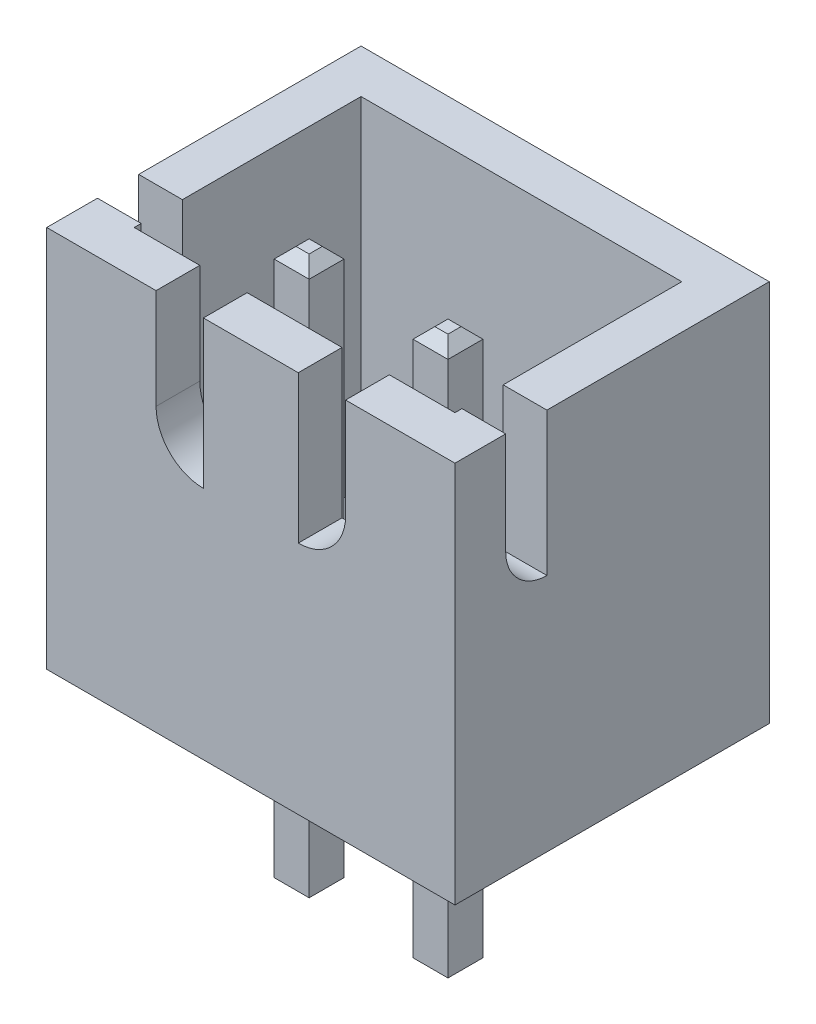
ISO-10303-21;
HEADER;
FILE_DESCRIPTION(('STEP AP214'),'2;1');
FILE_NAME('part.step','',(''),(''),'','','');
FILE_SCHEMA(('AUTOMOTIVE_DESIGN { 1 0 10303 214 1 1 1 1 }'));
ENDSEC;
DATA;
#1=APPLICATION_CONTEXT('core data for automotive mechanical design processes');
#2=APPLICATION_PROTOCOL_DEFINITION('international standard','automotive_design',2000,#1);
#3=PRODUCT_CONTEXT('',#1,'mechanical');
#4=PRODUCT('Part','Part','',(#3));
#5=PRODUCT_RELATED_PRODUCT_CATEGORY('part','',(#4));
#6=PRODUCT_DEFINITION_FORMATION('','',#4);
#7=PRODUCT_DEFINITION_CONTEXT('part definition',#1,'design');
#8=PRODUCT_DEFINITION('design','',#6,#7);
#9=PRODUCT_DEFINITION_SHAPE('','',#8);
#10=(LENGTH_UNIT() NAMED_UNIT(*) SI_UNIT(.MILLI.,.METRE.));
#11=(NAMED_UNIT(*) PLANE_ANGLE_UNIT() SI_UNIT($,.RADIAN.));
#12=(NAMED_UNIT(*) SI_UNIT($,.STERADIAN.) SOLID_ANGLE_UNIT());
#13=UNCERTAINTY_MEASURE_WITH_UNIT(LENGTH_MEASURE(1.E-05),#10,'distance_accuracy_value','');
#14=(GEOMETRIC_REPRESENTATION_CONTEXT(3) GLOBAL_UNCERTAINTY_ASSIGNED_CONTEXT((#13)) GLOBAL_UNIT_ASSIGNED_CONTEXT((#10,
#11,#12)) REPRESENTATION_CONTEXT('',''));
#15=CARTESIAN_POINT('',(0.,0.,0.));
#16=DIRECTION('',(0.,0.,1.));
#17=DIRECTION('',(1.,0.,0.));
#18=AXIS2_PLACEMENT_3D('',#15,#16,#17);
#19=CARTESIAN_POINT('',(0.,7.,0.));
#20=DIRECTION('',(0.,1.,0.));
#21=DIRECTION('',(0.,0.,1.));
#22=AXIS2_PLACEMENT_3D('',#19,#20,#21);
#23=PLANE('',#22);
#24=DIRECTION('',(0.,0.,1.));
#25=VECTOR('',#24,1.);
#26=CARTESIAN_POINT('',(1.7338,7.,-2.876));
#27=LINE('',#26,#25);
#28=CARTESIAN_POINT('',(1.7338,7.,2.075));
#29=VERTEX_POINT('',#28);
#30=CARTESIAN_POINT('',(1.7338,7.,2.875));
#31=VERTEX_POINT('',#30);
#32=EDGE_CURVE('E418',#29,#31,#27,.T.);
#33=ORIENTED_EDGE('',*,*,#32,.T.);
#34=DIRECTION('',(1.,0.,0.));
#35=VECTOR('',#34,1.);
#36=CARTESIAN_POINT('',(-3.7338,7.,2.875));
#37=LINE('',#36,#35);
#38=CARTESIAN_POINT('',(3.7338,7.,2.875));
#39=VERTEX_POINT('',#38);
#40=EDGE_CURVE('E536',#31,#39,#37,.T.);
#41=ORIENTED_EDGE('',*,*,#40,.T.);
#42=DIRECTION('',(0.,0.,-1.));
#43=VECTOR('',#42,1.);
#44=CARTESIAN_POINT('',(3.7338,7.,-2.875));
#45=LINE('',#44,#43);
#46=CARTESIAN_POINT('',(3.7338,7.,1.94691722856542));
#47=VERTEX_POINT('',#46);
#48=EDGE_CURVE('E526',#39,#47,#45,.T.);
#49=ORIENTED_EDGE('',*,*,#48,.T.);
#50=DIRECTION('',(1.,0.,0.));
#51=VECTOR('',#50,1.);
#52=CARTESIAN_POINT('',(-3.7338,7.,1.94691722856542));
#53=LINE('',#52,#51);
#54=CARTESIAN_POINT('',(2.9338,7.,1.94691722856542));
#55=VERTEX_POINT('',#54);
#56=EDGE_CURVE('E461',#55,#47,#53,.T.);
#57=ORIENTED_EDGE('',*,*,#56,.F.);
#58=DIRECTION('',(0.,0.,-1.));
#59=VECTOR('',#58,1.);
#60=CARTESIAN_POINT('',(2.9338,7.,-2.875));
#61=LINE('',#60,#59);
#62=CARTESIAN_POINT('',(2.9338,7.,2.075));
#63=VERTEX_POINT('',#62);
#64=EDGE_CURVE('E513',#63,#55,#61,.T.);
#65=ORIENTED_EDGE('',*,*,#64,.F.);
#66=DIRECTION('',(1.,0.,0.));
#67=VECTOR('',#66,1.);
#68=CARTESIAN_POINT('',(-3.7338,7.,2.075));
#69=LINE('',#68,#67);
#70=EDGE_CURVE('E522',#29,#63,#69,.T.);
#71=ORIENTED_EDGE('',*,*,#70,.F.);
#72=EDGE_LOOP('',(#33,#41,#49,#57,#65,#71));
#73=FACE_BOUND('',#72,.T.);
#74=ADVANCED_FACE('F35',(#73),#23,.T.);
#75=DIRECTION('',(0.,0.,1.));
#76=VECTOR('',#75,1.);
#77=CARTESIAN_POINT('',(-1.7338,7.,-2.876));
#78=LINE('',#77,#76);
#79=CARTESIAN_POINT('',(-1.7338,7.,2.075));
#80=VERTEX_POINT('',#79);
#81=CARTESIAN_POINT('',(-1.7338,7.,2.875));
#82=VERTEX_POINT('',#81);
#83=EDGE_CURVE('E438',#80,#82,#78,.T.);
#84=ORIENTED_EDGE('',*,*,#83,.F.);
#85=CARTESIAN_POINT('',(-2.9338,7.,2.075));
#86=VERTEX_POINT('',#85);
#87=EDGE_CURVE('E502',#86,#80,#69,.T.);
#88=ORIENTED_EDGE('',*,*,#87,.F.);
#89=DIRECTION('',(0.,0.,1.));
#90=VECTOR('',#89,1.);
#91=CARTESIAN_POINT('',(-2.9338,7.,-2.875));
#92=LINE('',#91,#90);
#93=CARTESIAN_POINT('',(-2.9338,7.,1.94691722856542));
#94=VERTEX_POINT('',#93);
#95=EDGE_CURVE('E518',#94,#86,#92,.T.);
#96=ORIENTED_EDGE('',*,*,#95,.F.);
#97=CARTESIAN_POINT('',(-3.7338,7.,1.94691722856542));
#98=VERTEX_POINT('',#97);
#99=EDGE_CURVE('E481',#98,#94,#53,.T.);
#100=ORIENTED_EDGE('',*,*,#99,.F.);
#101=DIRECTION('',(0.,0.,1.));
#102=VECTOR('',#101,1.);
#103=CARTESIAN_POINT('',(-3.7338,7.,-2.875));
#104=LINE('',#103,#102);
#105=CARTESIAN_POINT('',(-3.7338,7.,2.875));
#106=VERTEX_POINT('',#105);
#107=EDGE_CURVE('E532',#98,#106,#104,.T.);
#108=ORIENTED_EDGE('',*,*,#107,.T.);
#109=EDGE_CURVE('E537',#106,#82,#37,.T.);
#110=ORIENTED_EDGE('',*,*,#109,.T.);
#111=EDGE_LOOP('',(#84,#88,#96,#100,#108,#110));
#112=FACE_BOUND('',#111,.T.);
#113=ADVANCED_FACE('F740',(#112),#23,.T.);
#114=DIRECTION('',(1.,0.,0.));
#115=VECTOR('',#114,1.);
#116=CARTESIAN_POINT('',(-3.7338,7.,1.19301282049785));
#117=LINE('',#116,#115);
#118=CARTESIAN_POINT('',(2.9338,7.,1.19301282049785));
#119=VERTEX_POINT('',#118);
#120=CARTESIAN_POINT('',(3.7338,7.,1.19301282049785));
#121=VERTEX_POINT('',#120);
#122=EDGE_CURVE('E472',#119,#121,#117,.T.);
#123=ORIENTED_EDGE('',*,*,#122,.T.);
#124=CARTESIAN_POINT('',(3.7338,7.,-2.875));
#125=VERTEX_POINT('',#124);
#126=EDGE_CURVE('E530',#121,#125,#45,.T.);
#127=ORIENTED_EDGE('',*,*,#126,.T.);
#128=DIRECTION('',(-1.,0.,0.));
#129=VECTOR('',#128,1.);
#130=CARTESIAN_POINT('',(-3.7338,7.,-2.875));
#131=LINE('',#130,#129);
#132=CARTESIAN_POINT('',(-3.7338,7.,-2.875));
#133=VERTEX_POINT('',#132);
#134=EDGE_CURVE('E529',#125,#133,#131,.T.);
#135=ORIENTED_EDGE('',*,*,#134,.T.);
#136=CARTESIAN_POINT('',(-3.7338,7.,1.19301282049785));
#137=VERTEX_POINT('',#136);
#138=EDGE_CURVE('E533',#133,#137,#104,.T.);
#139=ORIENTED_EDGE('',*,*,#138,.T.);
#140=CARTESIAN_POINT('',(-2.9338,7.,1.19301282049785));
#141=VERTEX_POINT('',#140);
#142=EDGE_CURVE('E468',#137,#141,#117,.T.);
#143=ORIENTED_EDGE('',*,*,#142,.T.);
#144=CARTESIAN_POINT('',(-2.9338,7.,-2.075));
#145=VERTEX_POINT('',#144);
#146=EDGE_CURVE('E519',#145,#141,#92,.T.);
#147=ORIENTED_EDGE('',*,*,#146,.F.);
#148=DIRECTION('',(-1.,0.,0.));
#149=VECTOR('',#148,1.);
#150=CARTESIAN_POINT('',(-3.7338,7.,-2.075));
#151=LINE('',#150,#149);
#152=CARTESIAN_POINT('',(2.9338,7.,-2.075));
#153=VERTEX_POINT('',#152);
#154=EDGE_CURVE('E516',#153,#145,#151,.T.);
#155=ORIENTED_EDGE('',*,*,#154,.F.);
#156=EDGE_CURVE('E512',#119,#153,#61,.T.);
#157=ORIENTED_EDGE('',*,*,#156,.F.);
#158=EDGE_LOOP('',(#123,#127,#135,#139,#143,#147,#155,#157));
#159=FACE_BOUND('',#158,.T.);
#160=ADVANCED_FACE('F747',(#159),#23,.T.);
#161=CARTESIAN_POINT('',(3.7338,7.,-2.875));
#162=DIRECTION('',(-1.,0.,0.));
#163=DIRECTION('',(0.,0.,1.));
#164=AXIS2_PLACEMENT_3D('',#161,#162,#163);
#165=PLANE('',#164);
#166=ORIENTED_EDGE('',*,*,#126,.F.);
#167=DIRECTION('',(0.,1.,0.));
#168=VECTOR('',#167,1.);
#169=CARTESIAN_POINT('',(3.7338,7.,1.19301282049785));
#170=LINE('',#169,#168);
#171=CARTESIAN_POINT('',(3.7338,4.37960398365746,1.19301282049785));
#172=VERTEX_POINT('',#171);
#173=EDGE_CURVE('E455',#172,#121,#170,.T.);
#174=ORIENTED_EDGE('',*,*,#173,.F.);
#175=CARTESIAN_POINT('',(3.7338,5.13350839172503,1.19301282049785));
#176=DIRECTION('',(1.,0.,0.));
#177=DIRECTION('',(0.,0.,1.));
#178=AXIS2_PLACEMENT_3D('',#175,#176,#177);
#179=CIRCLE('',#178,0.753904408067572);
#180=CARTESIAN_POINT('',(3.7338,5.13350839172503,1.94691722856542));
#181=VERTEX_POINT('',#180);
#182=EDGE_CURVE('E464',#181,#172,#179,.T.);
#183=ORIENTED_EDGE('',*,*,#182,.F.);
#184=DIRECTION('',(0.,-1.,0.));
#185=VECTOR('',#184,1.);
#186=CARTESIAN_POINT('',(3.7338,5.13350839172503,1.94691722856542));
#187=LINE('',#186,#185);
#188=EDGE_CURVE('E450',#47,#181,#187,.T.);
#189=ORIENTED_EDGE('',*,*,#188,.F.);
#190=ORIENTED_EDGE('',*,*,#48,.F.);
#191=DIRECTION('',(0.,-1.,0.));
#192=VECTOR('',#191,1.);
#193=CARTESIAN_POINT('',(3.7338,7.,2.875));
#194=LINE('',#193,#192);
#195=CARTESIAN_POINT('',(3.7338,0.,2.875));
#196=VERTEX_POINT('',#195);
#197=EDGE_CURVE('E540',#39,#196,#194,.T.);
#198=ORIENTED_EDGE('',*,*,#197,.T.);
#199=DIRECTION('',(0.,0.,-1.));
#200=VECTOR('',#199,1.);
#201=CARTESIAN_POINT('',(3.7338,0.,-2.875));
#202=LINE('',#201,#200);
#203=CARTESIAN_POINT('',(3.7338,0.,-2.875));
#204=VERTEX_POINT('',#203);
#205=EDGE_CURVE('E496',#196,#204,#202,.T.);
#206=ORIENTED_EDGE('',*,*,#205,.T.);
#207=DIRECTION('',(0.,-1.,0.));
#208=VECTOR('',#207,1.);
#209=CARTESIAN_POINT('',(3.7338,7.,-2.875));
#210=LINE('',#209,#208);
#211=EDGE_CURVE('E558',#125,#204,#210,.T.);
#212=ORIENTED_EDGE('',*,*,#211,.F.);
#213=EDGE_LOOP('',(#166,#174,#183,#189,#190,#198,#206,#212));
#214=FACE_BOUND('',#213,.T.);
#215=ADVANCED_FACE('F764',(#214),#165,.F.);
#216=CARTESIAN_POINT('',(-3.7338,7.,-2.875));
#217=DIRECTION('',(0.,0.,1.));
#218=DIRECTION('',(1.,0.,0.));
#219=AXIS2_PLACEMENT_3D('',#216,#217,#218);
#220=PLANE('',#219);
#221=DIRECTION('',(-1.,0.,0.));
#222=VECTOR('',#221,1.);
#223=CARTESIAN_POINT('',(-3.7338,0.,-2.875));
#224=LINE('',#223,#222);
#225=CARTESIAN_POINT('',(-3.7338,0.,-2.875));
#226=VERTEX_POINT('',#225);
#227=EDGE_CURVE('E544',#204,#226,#224,.T.);
#228=ORIENTED_EDGE('',*,*,#227,.T.);
#229=DIRECTION('',(0.,-1.,0.));
#230=VECTOR('',#229,1.);
#231=CARTESIAN_POINT('',(-3.7338,7.,-2.875));
#232=LINE('',#231,#230);
#233=EDGE_CURVE('E555',#133,#226,#232,.T.);
#234=ORIENTED_EDGE('',*,*,#233,.F.);
#235=ORIENTED_EDGE('',*,*,#134,.F.);
#236=ORIENTED_EDGE('',*,*,#211,.T.);
#237=EDGE_LOOP('',(#228,#234,#235,#236));
#238=FACE_BOUND('',#237,.T.);
#239=ADVANCED_FACE('F769',(#238),#220,.F.);
#240=CARTESIAN_POINT('',(-3.7338,7.,-2.875));
#241=DIRECTION('',(1.,0.,0.));
#242=DIRECTION('',(0.,0.,-1.));
#243=AXIS2_PLACEMENT_3D('',#240,#241,#242);
#244=PLANE('',#243);
#245=CARTESIAN_POINT('',(-3.7338,5.13350839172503,1.19301282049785));
#246=DIRECTION('',(1.,0.,0.));
#247=DIRECTION('',(0.,0.,1.));
#248=AXIS2_PLACEMENT_3D('',#245,#246,#247);
#249=CIRCLE('',#248,0.753904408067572);
#250=CARTESIAN_POINT('',(-3.7338,5.13350839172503,1.94691722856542));
#251=VERTEX_POINT('',#250);
#252=CARTESIAN_POINT('',(-3.7338,4.37960398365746,1.19301282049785));
#253=VERTEX_POINT('',#252);
#254=EDGE_CURVE('E454',#251,#253,#249,.T.);
#255=ORIENTED_EDGE('',*,*,#254,.T.);
#256=DIRECTION('',(0.,1.,0.));
#257=VECTOR('',#256,1.);
#258=CARTESIAN_POINT('',(-3.7338,7.,1.19301282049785));
#259=LINE('',#258,#257);
#260=EDGE_CURVE('E458',#253,#137,#259,.T.);
#261=ORIENTED_EDGE('',*,*,#260,.T.);
#262=ORIENTED_EDGE('',*,*,#138,.F.);
#263=ORIENTED_EDGE('',*,*,#233,.T.);
#264=DIRECTION('',(0.,0.,1.));
#265=VECTOR('',#264,1.);
#266=CARTESIAN_POINT('',(-3.7338,0.,-2.875));
#267=LINE('',#266,#265);
#268=CARTESIAN_POINT('',(-3.7338,0.,2.875));
#269=VERTEX_POINT('',#268);
#270=EDGE_CURVE('E546',#226,#269,#267,.T.);
#271=ORIENTED_EDGE('',*,*,#270,.T.);
#272=DIRECTION('',(0.,-1.,0.));
#273=VECTOR('',#272,1.);
#274=CARTESIAN_POINT('',(-3.7338,7.,2.875));
#275=LINE('',#274,#273);
#276=EDGE_CURVE('E552',#106,#269,#275,.T.);
#277=ORIENTED_EDGE('',*,*,#276,.F.);
#278=ORIENTED_EDGE('',*,*,#107,.F.);
#279=DIRECTION('',(0.,-1.,0.));
#280=VECTOR('',#279,1.);
#281=CARTESIAN_POINT('',(-3.7338,5.13350839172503,1.94691722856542));
#282=LINE('',#281,#280);
#283=EDGE_CURVE('E451',#98,#251,#282,.T.);
#284=ORIENTED_EDGE('',*,*,#283,.T.);
#285=EDGE_LOOP('',(#255,#261,#262,#263,#271,#277,#278,#284));
#286=FACE_BOUND('',#285,.T.);
#287=ADVANCED_FACE('F759',(#286),#244,.F.);
#288=CARTESIAN_POINT('',(-3.7338,7.,2.875));
#289=DIRECTION('',(0.,0.,-1.));
#290=DIRECTION('',(-1.,0.,0.));
#291=AXIS2_PLACEMENT_3D('',#288,#289,#290);
#292=PLANE('',#291);
#293=ORIENTED_EDGE('',*,*,#40,.F.);
#294=DIRECTION('',(0.,1.,0.));
#295=VECTOR('',#294,1.);
#296=CARTESIAN_POINT('',(1.7338,7.,2.875));
#297=LINE('',#296,#295);
#298=CARTESIAN_POINT('',(1.7338,5.16630822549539,2.875));
#299=VERTEX_POINT('',#298);
#300=EDGE_CURVE('E407',#299,#31,#297,.T.);
#301=ORIENTED_EDGE('',*,*,#300,.F.);
#302=CARTESIAN_POINT('',(0.867568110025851,5.16630822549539,2.875));
#303=DIRECTION('',(0.,0.,1.));
#304=DIRECTION('',(-1.,0.,0.));
#305=AXIS2_PLACEMENT_3D('',#302,#303,#304);
#306=CIRCLE('',#305,0.866231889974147);
#307=CARTESIAN_POINT('',(0.867568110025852,4.30007633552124,2.875));
#308=VERTEX_POINT('',#307);
#309=EDGE_CURVE('E404',#308,#299,#306,.T.);
#310=ORIENTED_EDGE('',*,*,#309,.F.);
#311=DIRECTION('',(0.,-1.,0.));
#312=VECTOR('',#311,1.);
#313=CARTESIAN_POINT('',(0.867568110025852,4.30007633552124,2.875));
#314=LINE('',#313,#312);
#315=CARTESIAN_POINT('',(0.867568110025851,7.,2.875));
#316=VERTEX_POINT('',#315);
#317=EDGE_CURVE('E409',#316,#308,#314,.T.);
#318=ORIENTED_EDGE('',*,*,#317,.F.);
#319=CARTESIAN_POINT('',(-0.867568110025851,7.,2.875));
#320=VERTEX_POINT('',#319);
#321=EDGE_CURVE('E541',#320,#316,#37,.T.);
#322=ORIENTED_EDGE('',*,*,#321,.F.);
#323=DIRECTION('',(0.,1.,0.));
#324=VECTOR('',#323,1.);
#325=CARTESIAN_POINT('',(-0.867568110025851,4.30007633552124,2.875));
#326=LINE('',#325,#324);
#327=CARTESIAN_POINT('',(-0.867568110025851,4.30007633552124,2.875));
#328=VERTEX_POINT('',#327);
#329=EDGE_CURVE('E436',#328,#320,#326,.T.);
#330=ORIENTED_EDGE('',*,*,#329,.F.);
#331=CARTESIAN_POINT('',(-0.867568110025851,5.16630822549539,2.875));
#332=DIRECTION('',(0.,0.,1.));
#333=DIRECTION('',(1.,0.,0.));
#334=AXIS2_PLACEMENT_3D('',#331,#332,#333);
#335=CIRCLE('',#334,0.866231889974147);
#336=CARTESIAN_POINT('',(-1.7338,5.16630822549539,2.875));
#337=VERTEX_POINT('',#336);
#338=EDGE_CURVE('E433',#337,#328,#335,.T.);
#339=ORIENTED_EDGE('',*,*,#338,.F.);
#340=DIRECTION('',(0.,-1.,0.));
#341=VECTOR('',#340,1.);
#342=CARTESIAN_POINT('',(-1.7338,6.72892261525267,2.875));
#343=LINE('',#342,#341);
#344=EDGE_CURVE('E430',#82,#337,#343,.T.);
#345=ORIENTED_EDGE('',*,*,#344,.F.);
#346=ORIENTED_EDGE('',*,*,#109,.F.);
#347=ORIENTED_EDGE('',*,*,#276,.T.);
#348=DIRECTION('',(1.,0.,0.));
#349=VECTOR('',#348,1.);
#350=CARTESIAN_POINT('',(-3.7338,0.,2.875));
#351=LINE('',#350,#349);
#352=EDGE_CURVE('E548',#269,#196,#351,.T.);
#353=ORIENTED_EDGE('',*,*,#352,.T.);
#354=ORIENTED_EDGE('',*,*,#197,.F.);
#355=EDGE_LOOP('',(#293,#301,#310,#318,#322,#330,#339,#345,#346,#347,#353,#354));
#356=FACE_BOUND('',#355,.T.);
#357=ADVANCED_FACE('F752',(#356),#292,.F.);
#358=DIRECTION('',(0.,0.,1.));
#359=VECTOR('',#358,1.);
#360=CARTESIAN_POINT('',(0.867568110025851,7.,-2.876));
#361=LINE('',#360,#359);
#362=CARTESIAN_POINT('',(0.867568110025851,7.,2.075));
#363=VERTEX_POINT('',#362);
#364=EDGE_CURVE('E416',#363,#316,#361,.T.);
#365=ORIENTED_EDGE('',*,*,#364,.F.);
#366=CARTESIAN_POINT('',(-0.867568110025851,7.,2.075));
#367=VERTEX_POINT('',#366);
#368=EDGE_CURVE('E525',#367,#363,#69,.T.);
#369=ORIENTED_EDGE('',*,*,#368,.F.);
#370=DIRECTION('',(0.,0.,1.));
#371=VECTOR('',#370,1.);
#372=CARTESIAN_POINT('',(-0.867568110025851,7.,-2.876));
#373=LINE('',#372,#371);
#374=EDGE_CURVE('E439',#367,#320,#373,.T.);
#375=ORIENTED_EDGE('',*,*,#374,.T.);
#376=ORIENTED_EDGE('',*,*,#321,.T.);
#377=EDGE_LOOP('',(#365,#369,#375,#376));
#378=FACE_BOUND('',#377,.T.);
#379=ADVANCED_FACE('F743',(#378),#23,.T.);
#380=CARTESIAN_POINT('',(0.,0.,0.));
#381=DIRECTION('',(0.,1.,0.));
#382=DIRECTION('',(0.,0.,1.));
#383=AXIS2_PLACEMENT_3D('',#380,#381,#382);
#384=PLANE('',#383);
#385=DIRECTION('',(0.,0.,-1.));
#386=VECTOR('',#385,1.);
#387=CARTESIAN_POINT('',(1.5762,0.,0.));
#388=LINE('',#387,#386);
#389=CARTESIAN_POINT('',(1.5762,0.,0.845));
#390=VERTEX_POINT('',#389);
#391=CARTESIAN_POINT('',(1.5762,0.,0.205));
#392=VERTEX_POINT('',#391);
#393=EDGE_CURVE('E341',#390,#392,#388,.T.);
#394=ORIENTED_EDGE('',*,*,#393,.T.);
#395=DIRECTION('',(-1.,0.,0.));
#396=VECTOR('',#395,1.);
#397=CARTESIAN_POINT('',(0.,0.,0.205));
#398=LINE('',#397,#396);
#399=CARTESIAN_POINT('',(0.9362,0.,0.205));
#400=VERTEX_POINT('',#399);
#401=EDGE_CURVE('E369',#392,#400,#398,.T.);
#402=ORIENTED_EDGE('',*,*,#401,.T.);
#403=DIRECTION('',(0.,0.,1.));
#404=VECTOR('',#403,1.);
#405=CARTESIAN_POINT('',(0.9362,0.,0.));
#406=LINE('',#405,#404);
#407=CARTESIAN_POINT('',(0.9362,0.,0.845));
#408=VERTEX_POINT('',#407);
#409=EDGE_CURVE('E367',#400,#408,#406,.T.);
#410=ORIENTED_EDGE('',*,*,#409,.T.);
#411=DIRECTION('',(1.,0.,0.));
#412=VECTOR('',#411,1.);
#413=CARTESIAN_POINT('',(0.,0.,0.845));
#414=LINE('',#413,#412);
#415=EDGE_CURVE('E352',#408,#390,#414,.T.);
#416=ORIENTED_EDGE('',*,*,#415,.T.);
#417=EDGE_LOOP('',(#394,#402,#410,#416));
#418=FACE_BOUND('',#417,.T.);
#419=DIRECTION('',(1.,0.,0.));
#420=VECTOR('',#419,1.);
#421=CARTESIAN_POINT('',(0.,0.,0.845));
#422=LINE('',#421,#420);
#423=CARTESIAN_POINT('',(-1.6038,0.,0.845));
#424=VERTEX_POINT('',#423);
#425=CARTESIAN_POINT('',(-0.963799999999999,0.,0.845));
#426=VERTEX_POINT('',#425);
#427=EDGE_CURVE('E377',#424,#426,#422,.T.);
#428=ORIENTED_EDGE('',*,*,#427,.T.);
#429=DIRECTION('',(0.,0.,-1.));
#430=VECTOR('',#429,1.);
#431=CARTESIAN_POINT('',(-0.963799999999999,0.,0.));
#432=LINE('',#431,#430);
#433=CARTESIAN_POINT('',(-0.963799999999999,0.,0.205));
#434=VERTEX_POINT('',#433);
#435=EDGE_CURVE('E395',#426,#434,#432,.T.);
#436=ORIENTED_EDGE('',*,*,#435,.T.);
#437=DIRECTION('',(-1.,0.,0.));
#438=VECTOR('',#437,1.);
#439=CARTESIAN_POINT('',(0.,0.,0.205));
#440=LINE('',#439,#438);
#441=CARTESIAN_POINT('',(-1.6038,0.,0.205));
#442=VERTEX_POINT('',#441);
#443=EDGE_CURVE('E392',#434,#442,#440,.T.);
#444=ORIENTED_EDGE('',*,*,#443,.T.);
#445=DIRECTION('',(0.,0.,1.));
#446=VECTOR('',#445,1.);
#447=CARTESIAN_POINT('',(-1.6038,0.,0.));
#448=LINE('',#447,#446);
#449=EDGE_CURVE('E389',#442,#424,#448,.T.);
#450=ORIENTED_EDGE('',*,*,#449,.T.);
#451=EDGE_LOOP('',(#428,#436,#444,#450));
#452=FACE_BOUND('',#451,.T.);
#453=ORIENTED_EDGE('',*,*,#205,.F.);
#454=ORIENTED_EDGE('',*,*,#352,.F.);
#455=ORIENTED_EDGE('',*,*,#270,.F.);
#456=ORIENTED_EDGE('',*,*,#227,.F.);
#457=EDGE_LOOP('',(#453,#454,#455,#456));
#458=FACE_BOUND('',#457,.T.);
#459=ADVANCED_FACE('F365',(#418,#452,#458),#384,.F.);
#460=CARTESIAN_POINT('',(2.9338,7.,-2.875));
#461=DIRECTION('',(-1.,0.,0.));
#462=DIRECTION('',(0.,0.,1.));
#463=AXIS2_PLACEMENT_3D('',#460,#461,#462);
#464=PLANE('',#463);
#465=DIRECTION('',(0.,-1.,0.));
#466=VECTOR('',#465,1.);
#467=CARTESIAN_POINT('',(2.9338,7.,1.19301282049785));
#468=LINE('',#467,#466);
#469=CARTESIAN_POINT('',(2.9338,4.37960398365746,1.19301282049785));
#470=VERTEX_POINT('',#469);
#471=EDGE_CURVE('E487',#119,#470,#468,.T.);
#472=ORIENTED_EDGE('',*,*,#471,.F.);
#473=ORIENTED_EDGE('',*,*,#156,.T.);
#474=DIRECTION('',(0.,-1.,0.));
#475=VECTOR('',#474,1.);
#476=CARTESIAN_POINT('',(2.9338,7.,-2.075));
#477=LINE('',#476,#475);
#478=CARTESIAN_POINT('',(2.9338,0.8,-2.075));
#479=VERTEX_POINT('',#478);
#480=EDGE_CURVE('E493',#153,#479,#477,.T.);
#481=ORIENTED_EDGE('',*,*,#480,.T.);
#482=DIRECTION('',(0.,0.,-1.));
#483=VECTOR('',#482,1.);
#484=CARTESIAN_POINT('',(2.9338,0.8,-2.875));
#485=LINE('',#484,#483);
#486=CARTESIAN_POINT('',(2.9338,0.8,2.075));
#487=VERTEX_POINT('',#486);
#488=EDGE_CURVE('E489',#487,#479,#485,.T.);
#489=ORIENTED_EDGE('',*,*,#488,.F.);
#490=DIRECTION('',(0.,-1.,0.));
#491=VECTOR('',#490,1.);
#492=CARTESIAN_POINT('',(2.9338,7.,2.075));
#493=LINE('',#492,#491);
#494=EDGE_CURVE('E498',#63,#487,#493,.T.);
#495=ORIENTED_EDGE('',*,*,#494,.F.);
#496=ORIENTED_EDGE('',*,*,#64,.T.);
#497=DIRECTION('',(0.,1.,0.));
#498=VECTOR('',#497,1.);
#499=CARTESIAN_POINT('',(2.9338,7.,1.94691722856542));
#500=LINE('',#499,#498);
#501=CARTESIAN_POINT('',(2.9338,5.13350839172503,1.94691722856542));
#502=VERTEX_POINT('',#501);
#503=EDGE_CURVE('E471',#502,#55,#500,.T.);
#504=ORIENTED_EDGE('',*,*,#503,.F.);
#505=CARTESIAN_POINT('',(2.9338,5.13350839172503,1.19301282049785));
#506=DIRECTION('',(-1.,0.,0.));
#507=DIRECTION('',(0.,0.,1.));
#508=AXIS2_PLACEMENT_3D('',#505,#506,#507);
#509=CIRCLE('',#508,0.753904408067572);
#510=EDGE_CURVE('E484',#470,#502,#509,.T.);
#511=ORIENTED_EDGE('',*,*,#510,.F.);
#512=EDGE_LOOP('',(#472,#473,#481,#489,#495,#496,#504,#511));
#513=FACE_BOUND('',#512,.T.);
#514=ADVANCED_FACE('F758',(#513),#464,.T.);
#515=CARTESIAN_POINT('',(-3.7338,7.,-2.075));
#516=DIRECTION('',(0.,0.,1.));
#517=DIRECTION('',(1.,0.,0.));
#518=AXIS2_PLACEMENT_3D('',#515,#516,#517);
#519=PLANE('',#518);
#520=DIRECTION('',(-1.,0.,0.));
#521=VECTOR('',#520,1.);
#522=CARTESIAN_POINT('',(-3.7338,0.8,-2.075));
#523=LINE('',#522,#521);
#524=CARTESIAN_POINT('',(-2.9338,0.8,-2.075));
#525=VERTEX_POINT('',#524);
#526=EDGE_CURVE('E492',#479,#525,#523,.T.);
#527=ORIENTED_EDGE('',*,*,#526,.F.);
#528=ORIENTED_EDGE('',*,*,#480,.F.);
#529=ORIENTED_EDGE('',*,*,#154,.T.);
#530=DIRECTION('',(0.,-1.,0.));
#531=VECTOR('',#530,1.);
#532=CARTESIAN_POINT('',(-2.9338,7.,-2.075));
#533=LINE('',#532,#531);
#534=EDGE_CURVE('E497',#145,#525,#533,.T.);
#535=ORIENTED_EDGE('',*,*,#534,.T.);
#536=EDGE_LOOP('',(#527,#528,#529,#535));
#537=FACE_BOUND('',#536,.T.);
#538=ADVANCED_FACE('F802',(#537),#519,.T.);
#539=CARTESIAN_POINT('',(-2.9338,7.,-2.875));
#540=DIRECTION('',(1.,0.,0.));
#541=DIRECTION('',(0.,0.,-1.));
#542=AXIS2_PLACEMENT_3D('',#539,#540,#541);
#543=PLANE('',#542);
#544=DIRECTION('',(0.,1.,0.));
#545=VECTOR('',#544,1.);
#546=CARTESIAN_POINT('',(-2.9338,7.,1.19301282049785));
#547=LINE('',#546,#545);
#548=CARTESIAN_POINT('',(-2.9338,4.37960398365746,1.19301282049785));
#549=VERTEX_POINT('',#548);
#550=EDGE_CURVE('E565',#549,#141,#547,.T.);
#551=ORIENTED_EDGE('',*,*,#550,.F.);
#552=CARTESIAN_POINT('',(-2.9338,5.13350839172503,1.19301282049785));
#553=DIRECTION('',(1.,0.,0.));
#554=DIRECTION('',(0.,0.,-1.));
#555=AXIS2_PLACEMENT_3D('',#552,#553,#554);
#556=CIRCLE('',#555,0.753904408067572);
#557=CARTESIAN_POINT('',(-2.9338,5.13350839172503,1.94691722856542));
#558=VERTEX_POINT('',#557);
#559=EDGE_CURVE('E563',#558,#549,#556,.T.);
#560=ORIENTED_EDGE('',*,*,#559,.F.);
#561=DIRECTION('',(0.,-1.,0.));
#562=VECTOR('',#561,1.);
#563=CARTESIAN_POINT('',(-2.9338,7.,1.94691722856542));
#564=LINE('',#563,#562);
#565=EDGE_CURVE('E561',#94,#558,#564,.T.);
#566=ORIENTED_EDGE('',*,*,#565,.F.);
#567=ORIENTED_EDGE('',*,*,#95,.T.);
#568=DIRECTION('',(0.,-1.,0.));
#569=VECTOR('',#568,1.);
#570=CARTESIAN_POINT('',(-2.9338,7.,2.075));
#571=LINE('',#570,#569);
#572=CARTESIAN_POINT('',(-2.9338,0.8,2.075));
#573=VERTEX_POINT('',#572);
#574=EDGE_CURVE('E501',#86,#573,#571,.T.);
#575=ORIENTED_EDGE('',*,*,#574,.T.);
#576=DIRECTION('',(0.,0.,1.));
#577=VECTOR('',#576,1.);
#578=CARTESIAN_POINT('',(-2.9338,0.8,-2.875));
#579=LINE('',#578,#577);
#580=EDGE_CURVE('E504',#525,#573,#579,.T.);
#581=ORIENTED_EDGE('',*,*,#580,.F.);
#582=ORIENTED_EDGE('',*,*,#534,.F.);
#583=ORIENTED_EDGE('',*,*,#146,.T.);
#584=EDGE_LOOP('',(#551,#560,#566,#567,#575,#581,#582,#583));
#585=FACE_BOUND('',#584,.T.);
#586=ADVANCED_FACE('F796',(#585),#543,.T.);
#587=CARTESIAN_POINT('',(-3.7338,7.,2.075));
#588=DIRECTION('',(0.,0.,-1.));
#589=DIRECTION('',(-1.,0.,0.));
#590=AXIS2_PLACEMENT_3D('',#587,#588,#589);
#591=PLANE('',#590);
#592=DIRECTION('',(0.,1.,0.));
#593=VECTOR('',#592,1.);
#594=CARTESIAN_POINT('',(1.7338,7.,2.075));
#595=LINE('',#594,#593);
#596=CARTESIAN_POINT('',(1.7338,5.16630822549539,2.075));
#597=VERTEX_POINT('',#596);
#598=EDGE_CURVE('E415',#597,#29,#595,.T.);
#599=ORIENTED_EDGE('',*,*,#598,.T.);
#600=ORIENTED_EDGE('',*,*,#70,.T.);
#601=ORIENTED_EDGE('',*,*,#494,.T.);
#602=DIRECTION('',(1.,0.,0.));
#603=VECTOR('',#602,1.);
#604=CARTESIAN_POINT('',(-3.7338,0.8,2.075));
#605=LINE('',#604,#603);
#606=EDGE_CURVE('E508',#573,#487,#605,.T.);
#607=ORIENTED_EDGE('',*,*,#606,.F.);
#608=ORIENTED_EDGE('',*,*,#574,.F.);
#609=ORIENTED_EDGE('',*,*,#87,.T.);
#610=DIRECTION('',(0.,-1.,0.));
#611=VECTOR('',#610,1.);
#612=CARTESIAN_POINT('',(-1.7338,6.72892261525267,2.075));
#613=LINE('',#612,#611);
#614=CARTESIAN_POINT('',(-1.7338,5.16630822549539,2.075));
#615=VERTEX_POINT('',#614);
#616=EDGE_CURVE('E442',#80,#615,#613,.T.);
#617=ORIENTED_EDGE('',*,*,#616,.T.);
#618=CARTESIAN_POINT('',(-0.867568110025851,5.16630822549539,2.075));
#619=DIRECTION('',(0.,0.,-1.));
#620=DIRECTION('',(-1.,0.,0.));
#621=AXIS2_PLACEMENT_3D('',#618,#619,#620);
#622=CIRCLE('',#621,0.866231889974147);
#623=CARTESIAN_POINT('',(-0.867568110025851,4.30007633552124,2.075));
#624=VERTEX_POINT('',#623);
#625=EDGE_CURVE('E424',#615,#624,#622,.F.);
#626=ORIENTED_EDGE('',*,*,#625,.T.);
#627=DIRECTION('',(0.,1.,0.));
#628=VECTOR('',#627,1.);
#629=CARTESIAN_POINT('',(-0.867568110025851,4.30007633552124,2.075));
#630=LINE('',#629,#628);
#631=EDGE_CURVE('E427',#624,#367,#630,.T.);
#632=ORIENTED_EDGE('',*,*,#631,.T.);
#633=ORIENTED_EDGE('',*,*,#368,.T.);
#634=DIRECTION('',(0.,-1.,0.));
#635=VECTOR('',#634,1.);
#636=CARTESIAN_POINT('',(0.867568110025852,4.30007633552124,2.075));
#637=LINE('',#636,#635);
#638=CARTESIAN_POINT('',(0.867568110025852,4.30007633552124,2.075));
#639=VERTEX_POINT('',#638);
#640=EDGE_CURVE('E401',#363,#639,#637,.T.);
#641=ORIENTED_EDGE('',*,*,#640,.T.);
#642=CARTESIAN_POINT('',(0.867568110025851,5.16630822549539,2.075));
#643=DIRECTION('',(0.,0.,-1.));
#644=DIRECTION('',(-1.,0.,0.));
#645=AXIS2_PLACEMENT_3D('',#642,#643,#644);
#646=CIRCLE('',#645,0.866231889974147);
#647=EDGE_CURVE('E398',#639,#597,#646,.F.);
#648=ORIENTED_EDGE('',*,*,#647,.T.);
#649=EDGE_LOOP('',(#599,#600,#601,#607,#608,#609,#617,#626,#632,#633,#641,#648));
#650=FACE_BOUND('',#649,.T.);
#651=ADVANCED_FACE('F809',(#650),#591,.T.);
#652=CARTESIAN_POINT('',(0.,0.8,0.));
#653=DIRECTION('',(0.,1.,0.));
#654=DIRECTION('',(0.,0.,1.));
#655=AXIS2_PLACEMENT_3D('',#652,#653,#654);
#656=PLANE('',#655);
#657=DIRECTION('',(-1.,0.,0.));
#658=VECTOR('',#657,1.);
#659=CARTESIAN_POINT('',(0.,0.8,0.205));
#660=LINE('',#659,#658);
#661=CARTESIAN_POINT('',(1.5762,0.8,0.205));
#662=VERTEX_POINT('',#661);
#663=CARTESIAN_POINT('',(0.9362,0.8,0.205));
#664=VERTEX_POINT('',#663);
#665=EDGE_CURVE('E588',#662,#664,#660,.T.);
#666=ORIENTED_EDGE('',*,*,#665,.F.);
#667=DIRECTION('',(0.,0.,-1.));
#668=VECTOR('',#667,1.);
#669=CARTESIAN_POINT('',(1.5762,0.8,0.));
#670=LINE('',#669,#668);
#671=CARTESIAN_POINT('',(1.5762,0.8,0.845));
#672=VERTEX_POINT('',#671);
#673=EDGE_CURVE('E579',#672,#662,#670,.T.);
#674=ORIENTED_EDGE('',*,*,#673,.F.);
#675=DIRECTION('',(1.,0.,0.));
#676=VECTOR('',#675,1.);
#677=CARTESIAN_POINT('',(0.,0.8,0.845));
#678=LINE('',#677,#676);
#679=CARTESIAN_POINT('',(0.9362,0.8,0.845));
#680=VERTEX_POINT('',#679);
#681=EDGE_CURVE('E582',#680,#672,#678,.T.);
#682=ORIENTED_EDGE('',*,*,#681,.F.);
#683=DIRECTION('',(0.,0.,1.));
#684=VECTOR('',#683,1.);
#685=CARTESIAN_POINT('',(0.9362,0.8,0.));
#686=LINE('',#685,#684);
#687=EDGE_CURVE('E585',#664,#680,#686,.T.);
#688=ORIENTED_EDGE('',*,*,#687,.F.);
#689=EDGE_LOOP('',(#666,#674,#682,#688));
#690=FACE_BOUND('',#689,.T.);
#691=DIRECTION('',(0.,0.,-1.));
#692=VECTOR('',#691,1.);
#693=CARTESIAN_POINT('',(-0.963799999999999,0.8,0.));
#694=LINE('',#693,#692);
#695=CARTESIAN_POINT('',(-0.963799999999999,0.8,0.845));
#696=VERTEX_POINT('',#695);
#697=CARTESIAN_POINT('',(-0.963799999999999,0.8,0.205));
#698=VERTEX_POINT('',#697);
#699=EDGE_CURVE('E576',#696,#698,#694,.T.);
#700=ORIENTED_EDGE('',*,*,#699,.F.);
#701=DIRECTION('',(1.,0.,0.));
#702=VECTOR('',#701,1.);
#703=CARTESIAN_POINT('',(0.,0.8,0.845));
#704=LINE('',#703,#702);
#705=CARTESIAN_POINT('',(-1.6038,0.8,0.845));
#706=VERTEX_POINT('',#705);
#707=EDGE_CURVE('E567',#706,#696,#704,.T.);
#708=ORIENTED_EDGE('',*,*,#707,.F.);
#709=DIRECTION('',(0.,0.,1.));
#710=VECTOR('',#709,1.);
#711=CARTESIAN_POINT('',(-1.6038,0.8,0.));
#712=LINE('',#711,#710);
#713=CARTESIAN_POINT('',(-1.6038,0.8,0.205));
#714=VERTEX_POINT('',#713);
#715=EDGE_CURVE('E570',#714,#706,#712,.T.);
#716=ORIENTED_EDGE('',*,*,#715,.F.);
#717=DIRECTION('',(-1.,0.,0.));
#718=VECTOR('',#717,1.);
#719=CARTESIAN_POINT('',(0.,0.8,0.205));
#720=LINE('',#719,#718);
#721=EDGE_CURVE('E573',#698,#714,#720,.T.);
#722=ORIENTED_EDGE('',*,*,#721,.F.);
#723=EDGE_LOOP('',(#700,#708,#716,#722));
#724=FACE_BOUND('',#723,.T.);
#725=ORIENTED_EDGE('',*,*,#488,.T.);
#726=ORIENTED_EDGE('',*,*,#526,.T.);
#727=ORIENTED_EDGE('',*,*,#580,.T.);
#728=ORIENTED_EDGE('',*,*,#606,.T.);
#729=EDGE_LOOP('',(#725,#726,#727,#728));
#730=FACE_BOUND('',#729,.T.);
#731=ADVANCED_FACE('F722',(#690,#724,#730),#656,.T.);
#732=CARTESIAN_POINT('',(-3.7338,5.13350839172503,1.94691722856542));
#733=DIRECTION('',(0.,0.,1.));
#734=DIRECTION('',(1.,0.,0.));
#735=AXIS2_PLACEMENT_3D('',#732,#733,#734);
#736=PLANE('',#735);
#737=ORIENTED_EDGE('',*,*,#565,.T.);
#738=DIRECTION('',(1.,0.,0.));
#739=VECTOR('',#738,1.);
#740=CARTESIAN_POINT('',(-3.7338,5.13350839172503,1.94691722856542));
#741=LINE('',#740,#739);
#742=EDGE_CURVE('E477',#251,#558,#741,.T.);
#743=ORIENTED_EDGE('',*,*,#742,.F.);
#744=ORIENTED_EDGE('',*,*,#283,.F.);
#745=ORIENTED_EDGE('',*,*,#99,.T.);
#746=EDGE_LOOP('',(#737,#743,#744,#745));
#747=FACE_BOUND('',#746,.T.);
#748=ADVANCED_FACE('F836',(#747),#736,.F.);
#749=CARTESIAN_POINT('',(-3.7338,5.13350839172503,1.19301282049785));
#750=DIRECTION('',(1.,0.,0.));
#751=DIRECTION('',(0.,0.,-1.));
#752=AXIS2_PLACEMENT_3D('',#749,#750,#751);
#753=CYLINDRICAL_SURFACE('',#752,0.753904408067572);
#754=ORIENTED_EDGE('',*,*,#559,.T.);
#755=DIRECTION('',(1.,0.,0.));
#756=VECTOR('',#755,1.);
#757=CARTESIAN_POINT('',(-3.7338,4.37960398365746,1.19301282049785));
#758=LINE('',#757,#756);
#759=EDGE_CURVE('E473',#253,#549,#758,.T.);
#760=ORIENTED_EDGE('',*,*,#759,.F.);
#761=ORIENTED_EDGE('',*,*,#254,.F.);
#762=ORIENTED_EDGE('',*,*,#742,.T.);
#763=EDGE_LOOP('',(#754,#760,#761,#762));
#764=FACE_BOUND('',#763,.T.);
#765=ADVANCED_FACE('F830',(#764),#753,.F.);
#766=CARTESIAN_POINT('',(-3.7338,7.,1.19301282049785));
#767=DIRECTION('',(0.,0.,-1.));
#768=DIRECTION('',(-1.,0.,0.));
#769=AXIS2_PLACEMENT_3D('',#766,#767,#768);
#770=PLANE('',#769);
#771=ORIENTED_EDGE('',*,*,#550,.T.);
#772=ORIENTED_EDGE('',*,*,#142,.F.);
#773=ORIENTED_EDGE('',*,*,#260,.F.);
#774=ORIENTED_EDGE('',*,*,#759,.T.);
#775=EDGE_LOOP('',(#771,#772,#773,#774));
#776=FACE_BOUND('',#775,.T.);
#777=ADVANCED_FACE('F792',(#776),#770,.F.);
#778=ORIENTED_EDGE('',*,*,#471,.T.);
#779=EDGE_CURVE('E476',#470,#172,#758,.T.);
#780=ORIENTED_EDGE('',*,*,#779,.T.);
#781=ORIENTED_EDGE('',*,*,#173,.T.);
#782=ORIENTED_EDGE('',*,*,#122,.F.);
#783=EDGE_LOOP('',(#778,#780,#781,#782));
#784=FACE_BOUND('',#783,.T.);
#785=ADVANCED_FACE('F822',(#784),#770,.F.);
#786=ORIENTED_EDGE('',*,*,#510,.T.);
#787=EDGE_CURVE('E480',#502,#181,#741,.T.);
#788=ORIENTED_EDGE('',*,*,#787,.T.);
#789=ORIENTED_EDGE('',*,*,#182,.T.);
#790=ORIENTED_EDGE('',*,*,#779,.F.);
#791=EDGE_LOOP('',(#786,#788,#789,#790));
#792=FACE_BOUND('',#791,.T.);
#793=ADVANCED_FACE('F820',(#792),#753,.F.);
#794=ORIENTED_EDGE('',*,*,#503,.T.);
#795=ORIENTED_EDGE('',*,*,#56,.T.);
#796=ORIENTED_EDGE('',*,*,#188,.T.);
#797=ORIENTED_EDGE('',*,*,#787,.F.);
#798=EDGE_LOOP('',(#794,#795,#796,#797));
#799=FACE_BOUND('',#798,.T.);
#800=ADVANCED_FACE('F817',(#799),#736,.F.);
#801=CARTESIAN_POINT('',(-1.7338,6.72892261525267,-2.876));
#802=DIRECTION('',(-1.,0.,0.));
#803=DIRECTION('',(0.,-1.,0.));
#804=AXIS2_PLACEMENT_3D('',#801,#802,#803);
#805=PLANE('',#804);
#806=ORIENTED_EDGE('',*,*,#83,.T.);
#807=ORIENTED_EDGE('',*,*,#344,.T.);
#808=DIRECTION('',(0.,0.,1.));
#809=VECTOR('',#808,1.);
#810=CARTESIAN_POINT('',(-1.7338,5.16630822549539,-2.876));
#811=LINE('',#810,#809);
#812=EDGE_CURVE('E445',#615,#337,#811,.T.);
#813=ORIENTED_EDGE('',*,*,#812,.F.);
#814=ORIENTED_EDGE('',*,*,#616,.F.);
#815=EDGE_LOOP('',(#806,#807,#813,#814));
#816=FACE_BOUND('',#815,.T.);
#817=ADVANCED_FACE('F832',(#816),#805,.F.);
#818=CARTESIAN_POINT('',(-0.867568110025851,5.16630822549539,-2.876));
#819=DIRECTION('',(0.,0.,1.));
#820=DIRECTION('',(1.,0.,0.));
#821=AXIS2_PLACEMENT_3D('',#818,#819,#820);
#822=CYLINDRICAL_SURFACE('',#821,0.866231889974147);
#823=ORIENTED_EDGE('',*,*,#812,.T.);
#824=ORIENTED_EDGE('',*,*,#338,.T.);
#825=DIRECTION('',(0.,0.,1.));
#826=VECTOR('',#825,1.);
#827=CARTESIAN_POINT('',(-0.867568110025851,4.30007633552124,-2.876));
#828=LINE('',#827,#826);
#829=EDGE_CURVE('E443',#624,#328,#828,.T.);
#830=ORIENTED_EDGE('',*,*,#829,.F.);
#831=ORIENTED_EDGE('',*,*,#625,.F.);
#832=EDGE_LOOP('',(#823,#824,#830,#831));
#833=FACE_BOUND('',#832,.T.);
#834=ADVANCED_FACE('F1251',(#833),#822,.F.);
#835=CARTESIAN_POINT('',(-0.867568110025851,4.30007633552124,-2.876));
#836=DIRECTION('',(1.,0.,0.));
#837=DIRECTION('',(0.,1.,0.));
#838=AXIS2_PLACEMENT_3D('',#835,#836,#837);
#839=PLANE('',#838);
#840=ORIENTED_EDGE('',*,*,#829,.T.);
#841=ORIENTED_EDGE('',*,*,#329,.T.);
#842=ORIENTED_EDGE('',*,*,#374,.F.);
#843=ORIENTED_EDGE('',*,*,#631,.F.);
#844=EDGE_LOOP('',(#840,#841,#842,#843));
#845=FACE_BOUND('',#844,.T.);
#846=ADVANCED_FACE('F1240',(#845),#839,.F.);
#847=CARTESIAN_POINT('',(1.7338,7.,-2.876));
#848=DIRECTION('',(1.,0.,0.));
#849=DIRECTION('',(0.,0.,-1.));
#850=AXIS2_PLACEMENT_3D('',#847,#848,#849);
#851=PLANE('',#850);
#852=DIRECTION('',(0.,0.,1.));
#853=VECTOR('',#852,1.);
#854=CARTESIAN_POINT('',(1.7338,5.16630822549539,-2.876));
#855=LINE('',#854,#853);
#856=EDGE_CURVE('E412',#597,#299,#855,.T.);
#857=ORIENTED_EDGE('',*,*,#856,.T.);
#858=ORIENTED_EDGE('',*,*,#300,.T.);
#859=ORIENTED_EDGE('',*,*,#32,.F.);
#860=ORIENTED_EDGE('',*,*,#598,.F.);
#861=EDGE_LOOP('',(#857,#858,#859,#860));
#862=FACE_BOUND('',#861,.T.);
#863=ADVANCED_FACE('F1231',(#862),#851,.F.);
#864=CARTESIAN_POINT('',(0.867568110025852,4.30007633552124,-2.876));
#865=DIRECTION('',(-1.,0.,0.));
#866=DIRECTION('',(0.,-1.,0.));
#867=AXIS2_PLACEMENT_3D('',#864,#865,#866);
#868=PLANE('',#867);
#869=ORIENTED_EDGE('',*,*,#364,.T.);
#870=ORIENTED_EDGE('',*,*,#317,.T.);
#871=DIRECTION('',(0.,0.,1.));
#872=VECTOR('',#871,1.);
#873=CARTESIAN_POINT('',(0.867568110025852,4.30007633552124,-2.876));
#874=LINE('',#873,#872);
#875=EDGE_CURVE('E413',#639,#308,#874,.T.);
#876=ORIENTED_EDGE('',*,*,#875,.F.);
#877=ORIENTED_EDGE('',*,*,#640,.F.);
#878=EDGE_LOOP('',(#869,#870,#876,#877));
#879=FACE_BOUND('',#878,.T.);
#880=ADVANCED_FACE('F1221',(#879),#868,.F.);
#881=CARTESIAN_POINT('',(0.867568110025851,5.16630822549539,-2.876));
#882=DIRECTION('',(0.,0.,1.));
#883=DIRECTION('',(1.,0.,0.));
#884=AXIS2_PLACEMENT_3D('',#881,#882,#883);
#885=CYLINDRICAL_SURFACE('',#884,0.866231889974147);
#886=ORIENTED_EDGE('',*,*,#875,.T.);
#887=ORIENTED_EDGE('',*,*,#309,.T.);
#888=ORIENTED_EDGE('',*,*,#856,.F.);
#889=ORIENTED_EDGE('',*,*,#647,.F.);
#890=EDGE_LOOP('',(#886,#887,#888,#889));
#891=FACE_BOUND('',#890,.T.);
#892=ADVANCED_FACE('F937',(#891),#885,.F.);
#893=CARTESIAN_POINT('',(0.,6.75,0.));
#894=DIRECTION('',(0.,-1.,0.));
#895=DIRECTION('',(0.,0.,-1.));
#896=AXIS2_PLACEMENT_3D('',#893,#894,#895);
#897=PLANE('',#896);
#898=DIRECTION('',(0.,0.,1.));
#899=VECTOR('',#898,1.);
#900=CARTESIAN_POINT('',(-1.4038,6.75,0.845));
#901=LINE('',#900,#899);
#902=CARTESIAN_POINT('',(-1.4038,6.75,0.405));
#903=VERTEX_POINT('',#902);
#904=CARTESIAN_POINT('',(-1.4038,6.75,0.644999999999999));
#905=VERTEX_POINT('',#904);
#906=EDGE_CURVE('E651',#903,#905,#901,.T.);
#907=ORIENTED_EDGE('',*,*,#906,.T.);
#908=DIRECTION('',(1.,0.,0.));
#909=VECTOR('',#908,1.);
#910=CARTESIAN_POINT('',(-0.963799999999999,6.75,0.644999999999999));
#911=LINE('',#910,#909);
#912=CARTESIAN_POINT('',(-1.1638,6.75,0.644999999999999));
#913=VERTEX_POINT('',#912);
#914=EDGE_CURVE('E653',#905,#913,#911,.T.);
#915=ORIENTED_EDGE('',*,*,#914,.T.);
#916=DIRECTION('',(0.,0.,-1.));
#917=VECTOR('',#916,1.);
#918=CARTESIAN_POINT('',(-1.1638,6.75,0.205));
#919=LINE('',#918,#917);
#920=CARTESIAN_POINT('',(-1.1638,6.75,0.405));
#921=VERTEX_POINT('',#920);
#922=EDGE_CURVE('E647',#913,#921,#919,.T.);
#923=ORIENTED_EDGE('',*,*,#922,.T.);
#924=DIRECTION('',(-1.,0.,0.));
#925=VECTOR('',#924,1.);
#926=CARTESIAN_POINT('',(-1.6038,6.75,0.405));
#927=LINE('',#926,#925);
#928=EDGE_CURVE('E649',#921,#903,#927,.T.);
#929=ORIENTED_EDGE('',*,*,#928,.T.);
#930=EDGE_LOOP('',(#907,#915,#923,#929));
#931=FACE_BOUND('',#930,.T.);
#932=ADVANCED_FACE('F706',(#931),#897,.F.);
#933=CARTESIAN_POINT('',(-1.6038,6.75,0.845));
#934=DIRECTION('',(0.,0.,1.));
#935=DIRECTION('',(1.,0.,0.));
#936=AXIS2_PLACEMENT_3D('',#933,#934,#935);
#937=PLANE('',#936);
#938=DIRECTION('',(0.,-1.,0.));
#939=VECTOR('',#938,1.);
#940=CARTESIAN_POINT('',(-0.963799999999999,6.75,0.845));
#941=LINE('',#940,#939);
#942=CARTESIAN_POINT('',(-0.963799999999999,6.55,0.845));
#943=VERTEX_POINT('',#942);
#944=EDGE_CURVE('E385',#943,#696,#941,.T.);
#945=ORIENTED_EDGE('',*,*,#944,.F.);
#946=DIRECTION('',(-1.,0.,0.));
#947=VECTOR('',#946,1.);
#948=CARTESIAN_POINT('',(-1.6038,6.55,0.845));
#949=LINE('',#948,#947);
#950=CARTESIAN_POINT('',(-1.6038,6.55,0.845));
#951=VERTEX_POINT('',#950);
#952=EDGE_CURVE('E644',#943,#951,#949,.T.);
#953=ORIENTED_EDGE('',*,*,#952,.T.);
#954=DIRECTION('',(0.,-1.,0.));
#955=VECTOR('',#954,1.);
#956=CARTESIAN_POINT('',(-1.6038,6.75,0.845));
#957=LINE('',#956,#955);
#958=EDGE_CURVE('E382',#951,#706,#957,.T.);
#959=ORIENTED_EDGE('',*,*,#958,.T.);
#960=ORIENTED_EDGE('',*,*,#707,.T.);
#961=EDGE_LOOP('',(#945,#953,#959,#960));
#962=FACE_BOUND('',#961,.T.);
#963=ADVANCED_FACE('F715',(#962),#937,.T.);
#964=CARTESIAN_POINT('',(-1.6038,6.75,0.845));
#965=DIRECTION('',(-1.,0.,0.));
#966=DIRECTION('',(0.,0.,1.));
#967=AXIS2_PLACEMENT_3D('',#964,#965,#966);
#968=PLANE('',#967);
#969=ORIENTED_EDGE('',*,*,#958,.F.);
#970=DIRECTION('',(0.,0.,-1.));
#971=VECTOR('',#970,1.);
#972=CARTESIAN_POINT('',(-1.6038,6.55,0.205));
#973=LINE('',#972,#971);
#974=CARTESIAN_POINT('',(-1.6038,6.55,0.205));
#975=VERTEX_POINT('',#974);
#976=EDGE_CURVE('E59',#951,#975,#973,.T.);
#977=ORIENTED_EDGE('',*,*,#976,.T.);
#978=DIRECTION('',(0.,-1.,0.));
#979=VECTOR('',#978,1.);
#980=CARTESIAN_POINT('',(-1.6038,6.75,0.205));
#981=LINE('',#980,#979);
#982=EDGE_CURVE('E379',#975,#714,#981,.T.);
#983=ORIENTED_EDGE('',*,*,#982,.T.);
#984=ORIENTED_EDGE('',*,*,#715,.T.);
#985=EDGE_LOOP('',(#969,#977,#983,#984));
#986=FACE_BOUND('',#985,.T.);
#987=ADVANCED_FACE('F717',(#986),#968,.T.);
#988=CARTESIAN_POINT('',(-1.6038,6.75,0.205));
#989=DIRECTION('',(0.,0.,-1.));
#990=DIRECTION('',(-1.,0.,0.));
#991=AXIS2_PLACEMENT_3D('',#988,#989,#990);
#992=PLANE('',#991);
#993=ORIENTED_EDGE('',*,*,#982,.F.);
#994=DIRECTION('',(1.,0.,0.));
#995=VECTOR('',#994,1.);
#996=CARTESIAN_POINT('',(-0.963799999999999,6.55,0.205));
#997=LINE('',#996,#995);
#998=CARTESIAN_POINT('',(-0.963799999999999,6.55,0.205));
#999=VERTEX_POINT('',#998);
#1000=EDGE_CURVE('E44',#975,#999,#997,.T.);
#1001=ORIENTED_EDGE('',*,*,#1000,.T.);
#1002=DIRECTION('',(0.,-1.,0.));
#1003=VECTOR('',#1002,1.);
#1004=CARTESIAN_POINT('',(-0.963799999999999,6.75,0.205));
#1005=LINE('',#1004,#1003);
#1006=EDGE_CURVE('E375',#999,#698,#1005,.T.);
#1007=ORIENTED_EDGE('',*,*,#1006,.T.);
#1008=ORIENTED_EDGE('',*,*,#721,.T.);
#1009=EDGE_LOOP('',(#993,#1001,#1007,#1008));
#1010=FACE_BOUND('',#1009,.T.);
#1011=ADVANCED_FACE('F724',(#1010),#992,.T.);
#1012=CARTESIAN_POINT('',(-0.963799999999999,6.75,0.845));
#1013=DIRECTION('',(1.,0.,0.));
#1014=DIRECTION('',(0.,0.,-1.));
#1015=AXIS2_PLACEMENT_3D('',#1012,#1013,#1014);
#1016=PLANE('',#1015);
#1017=ORIENTED_EDGE('',*,*,#1006,.F.);
#1018=DIRECTION('',(0.,0.,1.));
#1019=VECTOR('',#1018,1.);
#1020=CARTESIAN_POINT('',(-0.963799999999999,6.55,0.845));
#1021=LINE('',#1020,#1019);
#1022=EDGE_CURVE('E11',#999,#943,#1021,.T.);
#1023=ORIENTED_EDGE('',*,*,#1022,.T.);
#1024=ORIENTED_EDGE('',*,*,#944,.T.);
#1025=ORIENTED_EDGE('',*,*,#699,.T.);
#1026=EDGE_LOOP('',(#1017,#1023,#1024,#1025));
#1027=FACE_BOUND('',#1026,.T.);
#1028=ADVANCED_FACE('F726',(#1027),#1016,.T.);
#1029=CARTESIAN_POINT('',(-0.963799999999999,-3.25,0.845));
#1030=VERTEX_POINT('',#1029);
#1031=EDGE_CURVE('E374',#426,#1030,#941,.T.);
#1032=ORIENTED_EDGE('',*,*,#1031,.T.);
#1033=DIRECTION('',(0.,0.,-1.));
#1034=VECTOR('',#1033,1.);
#1035=CARTESIAN_POINT('',(-0.963799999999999,-3.25,0.845));
#1036=LINE('',#1035,#1034);
#1037=CARTESIAN_POINT('',(-0.963799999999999,-3.25,0.205));
#1038=VERTEX_POINT('',#1037);
#1039=EDGE_CURVE('E624',#1030,#1038,#1036,.T.);
#1040=ORIENTED_EDGE('',*,*,#1039,.T.);
#1041=EDGE_CURVE('E378',#434,#1038,#1005,.T.);
#1042=ORIENTED_EDGE('',*,*,#1041,.F.);
#1043=ORIENTED_EDGE('',*,*,#435,.F.);
#1044=EDGE_LOOP('',(#1032,#1040,#1042,#1043));
#1045=FACE_BOUND('',#1044,.T.);
#1046=ADVANCED_FACE('F728',(#1045),#1016,.T.);
#1047=ORIENTED_EDGE('',*,*,#1041,.T.);
#1048=DIRECTION('',(-1.,0.,0.));
#1049=VECTOR('',#1048,1.);
#1050=CARTESIAN_POINT('',(-1.6038,-3.25,0.205));
#1051=LINE('',#1050,#1049);
#1052=CARTESIAN_POINT('',(-1.6038,-3.25,0.205));
#1053=VERTEX_POINT('',#1052);
#1054=EDGE_CURVE('E617',#1038,#1053,#1051,.T.);
#1055=ORIENTED_EDGE('',*,*,#1054,.T.);
#1056=EDGE_CURVE('E381',#442,#1053,#981,.T.);
#1057=ORIENTED_EDGE('',*,*,#1056,.F.);
#1058=ORIENTED_EDGE('',*,*,#443,.F.);
#1059=EDGE_LOOP('',(#1047,#1055,#1057,#1058));
#1060=FACE_BOUND('',#1059,.T.);
#1061=ADVANCED_FACE('F734',(#1060),#992,.T.);
#1062=ORIENTED_EDGE('',*,*,#1056,.T.);
#1063=DIRECTION('',(0.,0.,1.));
#1064=VECTOR('',#1063,1.);
#1065=CARTESIAN_POINT('',(-1.6038,-3.25,0.845));
#1066=LINE('',#1065,#1064);
#1067=CARTESIAN_POINT('',(-1.6038,-3.25,0.845));
#1068=VERTEX_POINT('',#1067);
#1069=EDGE_CURVE('E620',#1053,#1068,#1066,.T.);
#1070=ORIENTED_EDGE('',*,*,#1069,.T.);
#1071=EDGE_CURVE('E384',#424,#1068,#957,.T.);
#1072=ORIENTED_EDGE('',*,*,#1071,.F.);
#1073=ORIENTED_EDGE('',*,*,#449,.F.);
#1074=EDGE_LOOP('',(#1062,#1070,#1072,#1073));
#1075=FACE_BOUND('',#1074,.T.);
#1076=ADVANCED_FACE('F940',(#1075),#968,.T.);
#1077=ORIENTED_EDGE('',*,*,#1071,.T.);
#1078=DIRECTION('',(1.,0.,0.));
#1079=VECTOR('',#1078,1.);
#1080=CARTESIAN_POINT('',(-1.6038,-3.25,0.845));
#1081=LINE('',#1080,#1079);
#1082=EDGE_CURVE('E622',#1068,#1030,#1081,.T.);
#1083=ORIENTED_EDGE('',*,*,#1082,.T.);
#1084=ORIENTED_EDGE('',*,*,#1031,.F.);
#1085=ORIENTED_EDGE('',*,*,#427,.F.);
#1086=EDGE_LOOP('',(#1077,#1083,#1084,#1085));
#1087=FACE_BOUND('',#1086,.T.);
#1088=ADVANCED_FACE('F924',(#1087),#937,.T.);
#1089=CARTESIAN_POINT('',(0.,-3.45,0.));
#1090=DIRECTION('',(0.,-1.,0.));
#1091=DIRECTION('',(0.,0.,-1.));
#1092=AXIS2_PLACEMENT_3D('',#1089,#1090,#1091);
#1093=PLANE('',#1092);
#1094=DIRECTION('',(0.,0.,-1.));
#1095=VECTOR('',#1094,1.);
#1096=CARTESIAN_POINT('',(-1.4038,-3.45,0.));
#1097=LINE('',#1096,#1095);
#1098=CARTESIAN_POINT('',(-1.4038,-3.45,0.644999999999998));
#1099=VERTEX_POINT('',#1098);
#1100=CARTESIAN_POINT('',(-1.4038,-3.45,0.405000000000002));
#1101=VERTEX_POINT('',#1100);
#1102=EDGE_CURVE('E612',#1099,#1101,#1097,.T.);
#1103=ORIENTED_EDGE('',*,*,#1102,.T.);
#1104=DIRECTION('',(1.,0.,0.));
#1105=VECTOR('',#1104,1.);
#1106=CARTESIAN_POINT('',(0.,-3.45,0.405000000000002));
#1107=LINE('',#1106,#1105);
#1108=CARTESIAN_POINT('',(-1.1638,-3.45,0.405000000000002));
#1109=VERTEX_POINT('',#1108);
#1110=EDGE_CURVE('E614',#1101,#1109,#1107,.T.);
#1111=ORIENTED_EDGE('',*,*,#1110,.T.);
#1112=DIRECTION('',(0.,0.,1.));
#1113=VECTOR('',#1112,1.);
#1114=CARTESIAN_POINT('',(-1.1638,-3.45,0.));
#1115=LINE('',#1114,#1113);
#1116=CARTESIAN_POINT('',(-1.1638,-3.45,0.644999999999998));
#1117=VERTEX_POINT('',#1116);
#1118=EDGE_CURVE('E608',#1109,#1117,#1115,.T.);
#1119=ORIENTED_EDGE('',*,*,#1118,.T.);
#1120=DIRECTION('',(-1.,0.,0.));
#1121=VECTOR('',#1120,1.);
#1122=CARTESIAN_POINT('',(0.,-3.45,0.644999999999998));
#1123=LINE('',#1122,#1121);
#1124=EDGE_CURVE('E610',#1117,#1099,#1123,.T.);
#1125=ORIENTED_EDGE('',*,*,#1124,.T.);
#1126=EDGE_LOOP('',(#1103,#1111,#1119,#1125));
#1127=FACE_BOUND('',#1126,.T.);
#1128=ADVANCED_FACE('F917',(#1127),#1093,.T.);
#1129=CARTESIAN_POINT('',(0.,6.75,0.));
#1130=DIRECTION('',(0.,1.,0.));
#1131=DIRECTION('',(0.,0.,1.));
#1132=AXIS2_PLACEMENT_3D('',#1129,#1130,#1131);
#1133=PLANE('',#1132);
#1134=DIRECTION('',(1.,0.,0.));
#1135=VECTOR('',#1134,1.);
#1136=CARTESIAN_POINT('',(0.,6.75,0.645000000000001));
#1137=LINE('',#1136,#1135);
#1138=CARTESIAN_POINT('',(1.1362,6.75,0.645000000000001));
#1139=VERTEX_POINT('',#1138);
#1140=CARTESIAN_POINT('',(1.3762,6.75,0.645000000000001));
#1141=VERTEX_POINT('',#1140);
#1142=EDGE_CURVE('E633',#1139,#1141,#1137,.T.);
#1143=ORIENTED_EDGE('',*,*,#1142,.T.);
#1144=DIRECTION('',(0.,0.,-1.));
#1145=VECTOR('',#1144,1.);
#1146=CARTESIAN_POINT('',(1.3762,6.75,0.));
#1147=LINE('',#1146,#1145);
#1148=CARTESIAN_POINT('',(1.3762,6.75,0.404999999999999));
#1149=VERTEX_POINT('',#1148);
#1150=EDGE_CURVE('E635',#1141,#1149,#1147,.T.);
#1151=ORIENTED_EDGE('',*,*,#1150,.T.);
#1152=DIRECTION('',(-1.,0.,0.));
#1153=VECTOR('',#1152,1.);
#1154=CARTESIAN_POINT('',(0.,6.75,0.404999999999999));
#1155=LINE('',#1154,#1153);
#1156=CARTESIAN_POINT('',(1.1362,6.75,0.404999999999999));
#1157=VERTEX_POINT('',#1156);
#1158=EDGE_CURVE('E629',#1149,#1157,#1155,.T.);
#1159=ORIENTED_EDGE('',*,*,#1158,.T.);
#1160=DIRECTION('',(0.,0.,1.));
#1161=VECTOR('',#1160,1.);
#1162=CARTESIAN_POINT('',(1.1362,6.75,0.));
#1163=LINE('',#1162,#1161);
#1164=EDGE_CURVE('E631',#1157,#1139,#1163,.T.);
#1165=ORIENTED_EDGE('',*,*,#1164,.T.);
#1166=EDGE_LOOP('',(#1143,#1151,#1159,#1165));
#1167=FACE_BOUND('',#1166,.T.);
#1168=ADVANCED_FACE('F915',(#1167),#1133,.T.);
#1169=CARTESIAN_POINT('',(1.5762,6.75,0.845));
#1170=DIRECTION('',(1.,0.,0.));
#1171=DIRECTION('',(0.,0.,-1.));
#1172=AXIS2_PLACEMENT_3D('',#1169,#1170,#1171);
#1173=PLANE('',#1172);
#1174=DIRECTION('',(0.,-1.,0.));
#1175=VECTOR('',#1174,1.);
#1176=CARTESIAN_POINT('',(1.5762,6.75,0.205));
#1177=LINE('',#1176,#1175);
#1178=CARTESIAN_POINT('',(1.5762,6.55,0.205));
#1179=VERTEX_POINT('',#1178);
#1180=EDGE_CURVE('E362',#1179,#662,#1177,.T.);
#1181=ORIENTED_EDGE('',*,*,#1180,.F.);
#1182=DIRECTION('',(0.,0.,1.));
#1183=VECTOR('',#1182,1.);
#1184=CARTESIAN_POINT('',(1.5762,6.55,0.845));
#1185=LINE('',#1184,#1183);
#1186=CARTESIAN_POINT('',(1.5762,6.55,0.845));
#1187=VERTEX_POINT('',#1186);
#1188=EDGE_CURVE('E626',#1179,#1187,#1185,.T.);
#1189=ORIENTED_EDGE('',*,*,#1188,.T.);
#1190=DIRECTION('',(0.,-1.,0.));
#1191=VECTOR('',#1190,1.);
#1192=CARTESIAN_POINT('',(1.5762,6.75,0.845));
#1193=LINE('',#1192,#1191);
#1194=EDGE_CURVE('E361',#1187,#672,#1193,.T.);
#1195=ORIENTED_EDGE('',*,*,#1194,.T.);
#1196=ORIENTED_EDGE('',*,*,#673,.T.);
#1197=EDGE_LOOP('',(#1181,#1189,#1195,#1196));
#1198=FACE_BOUND('',#1197,.T.);
#1199=ADVANCED_FACE('F860',(#1198),#1173,.T.);
#1200=CARTESIAN_POINT('',(0.9362,6.75,0.845));
#1201=DIRECTION('',(0.,0.,1.));
#1202=DIRECTION('',(1.,0.,0.));
#1203=AXIS2_PLACEMENT_3D('',#1200,#1201,#1202);
#1204=PLANE('',#1203);
#1205=ORIENTED_EDGE('',*,*,#1194,.F.);
#1206=DIRECTION('',(-1.,0.,0.));
#1207=VECTOR('',#1206,1.);
#1208=CARTESIAN_POINT('',(0.9362,6.55,0.845));
#1209=LINE('',#1208,#1207);
#1210=CARTESIAN_POINT('',(0.9362,6.55,0.845));
#1211=VERTEX_POINT('',#1210);
#1212=EDGE_CURVE('E638',#1187,#1211,#1209,.T.);
#1213=ORIENTED_EDGE('',*,*,#1212,.T.);
#1214=DIRECTION('',(0.,-1.,0.));
#1215=VECTOR('',#1214,1.);
#1216=CARTESIAN_POINT('',(0.9362,6.75,0.845));
#1217=LINE('',#1216,#1215);
#1218=EDGE_CURVE('E866',#1211,#680,#1217,.T.);
#1219=ORIENTED_EDGE('',*,*,#1218,.T.);
#1220=ORIENTED_EDGE('',*,*,#681,.T.);
#1221=EDGE_LOOP('',(#1205,#1213,#1219,#1220));
#1222=FACE_BOUND('',#1221,.T.);
#1223=ADVANCED_FACE('F892',(#1222),#1204,.T.);
#1224=CARTESIAN_POINT('',(0.9362,6.75,0.845));
#1225=DIRECTION('',(-1.,0.,0.));
#1226=DIRECTION('',(0.,0.,1.));
#1227=AXIS2_PLACEMENT_3D('',#1224,#1225,#1226);
#1228=PLANE('',#1227);
#1229=ORIENTED_EDGE('',*,*,#1218,.F.);
#1230=DIRECTION('',(0.,0.,-1.));
#1231=VECTOR('',#1230,1.);
#1232=CARTESIAN_POINT('',(0.9362,6.55,0.845));
#1233=LINE('',#1232,#1231);
#1234=CARTESIAN_POINT('',(0.9362,6.55,0.205));
#1235=VERTEX_POINT('',#1234);
#1236=EDGE_CURVE('E640',#1211,#1235,#1233,.T.);
#1237=ORIENTED_EDGE('',*,*,#1236,.T.);
#1238=DIRECTION('',(0.,-1.,0.));
#1239=VECTOR('',#1238,1.);
#1240=CARTESIAN_POINT('',(0.9362,6.75,0.205));
#1241=LINE('',#1240,#1239);
#1242=EDGE_CURVE('E353',#1235,#664,#1241,.T.);
#1243=ORIENTED_EDGE('',*,*,#1242,.T.);
#1244=ORIENTED_EDGE('',*,*,#687,.T.);
#1245=EDGE_LOOP('',(#1229,#1237,#1243,#1244));
#1246=FACE_BOUND('',#1245,.T.);
#1247=ADVANCED_FACE('F896',(#1246),#1228,.T.);
#1248=CARTESIAN_POINT('',(0.9362,6.75,0.205));
#1249=DIRECTION('',(0.,0.,-1.));
#1250=DIRECTION('',(-1.,0.,0.));
#1251=AXIS2_PLACEMENT_3D('',#1248,#1249,#1250);
#1252=PLANE('',#1251);
#1253=ORIENTED_EDGE('',*,*,#1242,.F.);
#1254=DIRECTION('',(1.,0.,0.));
#1255=VECTOR('',#1254,1.);
#1256=CARTESIAN_POINT('',(0.9362,6.55,0.205));
#1257=LINE('',#1256,#1255);
#1258=EDGE_CURVE('E642',#1235,#1179,#1257,.T.);
#1259=ORIENTED_EDGE('',*,*,#1258,.T.);
#1260=ORIENTED_EDGE('',*,*,#1180,.T.);
#1261=ORIENTED_EDGE('',*,*,#665,.T.);
#1262=EDGE_LOOP('',(#1253,#1259,#1260,#1261));
#1263=FACE_BOUND('',#1262,.T.);
#1264=ADVANCED_FACE('F898',(#1263),#1252,.T.);
#1265=CARTESIAN_POINT('',(1.5762,-3.25,0.205));
#1266=VERTEX_POINT('',#1265);
#1267=EDGE_CURVE('E347',#392,#1266,#1177,.T.);
#1268=ORIENTED_EDGE('',*,*,#1267,.T.);
#1269=DIRECTION('',(-1.,0.,0.));
#1270=VECTOR('',#1269,1.);
#1271=CARTESIAN_POINT('',(0.9362,-3.25,0.205));
#1272=LINE('',#1271,#1270);
#1273=CARTESIAN_POINT('',(0.9362,-3.25,0.205));
#1274=VERTEX_POINT('',#1273);
#1275=EDGE_CURVE('E606',#1266,#1274,#1272,.T.);
#1276=ORIENTED_EDGE('',*,*,#1275,.T.);
#1277=EDGE_CURVE('E890',#400,#1274,#1241,.T.);
#1278=ORIENTED_EDGE('',*,*,#1277,.F.);
#1279=ORIENTED_EDGE('',*,*,#401,.F.);
#1280=EDGE_LOOP('',(#1268,#1276,#1278,#1279));
#1281=FACE_BOUND('',#1280,.T.);
#1282=ADVANCED_FACE('F871',(#1281),#1252,.T.);
#1283=ORIENTED_EDGE('',*,*,#1277,.T.);
#1284=DIRECTION('',(0.,0.,1.));
#1285=VECTOR('',#1284,1.);
#1286=CARTESIAN_POINT('',(0.9362,-3.25,0.845));
#1287=LINE('',#1286,#1285);
#1288=CARTESIAN_POINT('',(0.9362,-3.25,0.845));
#1289=VERTEX_POINT('',#1288);
#1290=EDGE_CURVE('E600',#1274,#1289,#1287,.T.);
#1291=ORIENTED_EDGE('',*,*,#1290,.T.);
#1292=EDGE_CURVE('E865',#408,#1289,#1217,.T.);
#1293=ORIENTED_EDGE('',*,*,#1292,.F.);
#1294=ORIENTED_EDGE('',*,*,#409,.F.);
#1295=EDGE_LOOP('',(#1283,#1291,#1293,#1294));
#1296=FACE_BOUND('',#1295,.T.);
#1297=ADVANCED_FACE('F889',(#1296),#1228,.T.);
#1298=ORIENTED_EDGE('',*,*,#1292,.T.);
#1299=DIRECTION('',(1.,0.,0.));
#1300=VECTOR('',#1299,1.);
#1301=CARTESIAN_POINT('',(1.5762,-3.25,0.845));
#1302=LINE('',#1301,#1300);
#1303=CARTESIAN_POINT('',(1.5762,-3.25,0.845));
#1304=VERTEX_POINT('',#1303);
#1305=EDGE_CURVE('E360',#1289,#1304,#1302,.T.);
#1306=ORIENTED_EDGE('',*,*,#1305,.T.);
#1307=EDGE_CURVE('E344',#390,#1304,#1193,.T.);
#1308=ORIENTED_EDGE('',*,*,#1307,.F.);
#1309=ORIENTED_EDGE('',*,*,#415,.F.);
#1310=EDGE_LOOP('',(#1298,#1306,#1308,#1309));
#1311=FACE_BOUND('',#1310,.T.);
#1312=ADVANCED_FACE('F357',(#1311),#1204,.T.);
#1313=ORIENTED_EDGE('',*,*,#1307,.T.);
#1314=DIRECTION('',(0.,0.,-1.));
#1315=VECTOR('',#1314,1.);
#1316=CARTESIAN_POINT('',(1.5762,-3.25,0.205));
#1317=LINE('',#1316,#1315);
#1318=EDGE_CURVE('E604',#1304,#1266,#1317,.T.);
#1319=ORIENTED_EDGE('',*,*,#1318,.T.);
#1320=ORIENTED_EDGE('',*,*,#1267,.F.);
#1321=ORIENTED_EDGE('',*,*,#393,.F.);
#1322=EDGE_LOOP('',(#1313,#1319,#1320,#1321));
#1323=FACE_BOUND('',#1322,.T.);
#1324=ADVANCED_FACE('F343',(#1323),#1173,.T.);
#1325=CARTESIAN_POINT('',(0.,-3.45,0.));
#1326=DIRECTION('',(0.,1.,0.));
#1327=DIRECTION('',(0.,0.,1.));
#1328=AXIS2_PLACEMENT_3D('',#1325,#1326,#1327);
#1329=PLANE('',#1328);
#1330=DIRECTION('',(-1.,0.,0.));
#1331=VECTOR('',#1330,1.);
#1332=CARTESIAN_POINT('',(0.9362,-3.45,0.645000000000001));
#1333=LINE('',#1332,#1331);
#1334=CARTESIAN_POINT('',(1.3762,-3.45,0.645000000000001));
#1335=VERTEX_POINT('',#1334);
#1336=CARTESIAN_POINT('',(1.1362,-3.45,0.645000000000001));
#1337=VERTEX_POINT('',#1336);
#1338=EDGE_CURVE('E595',#1335,#1337,#1333,.T.);
#1339=ORIENTED_EDGE('',*,*,#1338,.T.);
#1340=DIRECTION('',(0.,0.,-1.));
#1341=VECTOR('',#1340,1.);
#1342=CARTESIAN_POINT('',(1.1362,-3.45,0.205));
#1343=LINE('',#1342,#1341);
#1344=CARTESIAN_POINT('',(1.1362,-3.45,0.404999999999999));
#1345=VERTEX_POINT('',#1344);
#1346=EDGE_CURVE('E597',#1337,#1345,#1343,.T.);
#1347=ORIENTED_EDGE('',*,*,#1346,.T.);
#1348=DIRECTION('',(1.,0.,0.));
#1349=VECTOR('',#1348,1.);
#1350=CARTESIAN_POINT('',(1.5762,-3.45,0.404999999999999));
#1351=LINE('',#1350,#1349);
#1352=CARTESIAN_POINT('',(1.3762,-3.45,0.404999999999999));
#1353=VERTEX_POINT('',#1352);
#1354=EDGE_CURVE('E591',#1345,#1353,#1351,.T.);
#1355=ORIENTED_EDGE('',*,*,#1354,.T.);
#1356=DIRECTION('',(0.,0.,1.));
#1357=VECTOR('',#1356,1.);
#1358=CARTESIAN_POINT('',(1.3762,-3.45,0.845));
#1359=LINE('',#1358,#1357);
#1360=EDGE_CURVE('E593',#1353,#1335,#1359,.T.);
#1361=ORIENTED_EDGE('',*,*,#1360,.T.);
#1362=EDGE_LOOP('',(#1339,#1347,#1355,#1361));
#1363=FACE_BOUND('',#1362,.T.);
#1364=ADVANCED_FACE('F929',(#1363),#1329,.F.);
#1365=CARTESIAN_POINT('',(1.3762,-3.45,0.));
#1366=DIRECTION('',(0.70710678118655,-0.707106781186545,0.));
#1367=DIRECTION('',(0.,0.,-1.));
#1368=AXIS2_PLACEMENT_3D('',#1365,#1366,#1367);
#1369=PLANE('',#1368);
#1370=DIRECTION('',(-0.577350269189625,-0.577350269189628,0.577350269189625));
#1371=VECTOR('',#1370,1.);
#1372=CARTESIAN_POINT('',(0.91746666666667,-3.90873333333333,0.863733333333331));
#1373=LINE('',#1372,#1371);
#1374=EDGE_CURVE('E663',#1266,#1353,#1373,.T.);
#1375=ORIENTED_EDGE('',*,*,#1374,.F.);
#1376=ORIENTED_EDGE('',*,*,#1318,.F.);
#1377=DIRECTION('',(-0.577350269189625,-0.577350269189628,-0.577350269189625));
#1378=VECTOR('',#1377,1.);
#1379=CARTESIAN_POINT('',(1.1612,-3.665,0.430000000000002));
#1380=LINE('',#1379,#1378);
#1381=EDGE_CURVE('E666',#1335,#1304,#1380,.F.);
#1382=ORIENTED_EDGE('',*,*,#1381,.F.);
#1383=ORIENTED_EDGE('',*,*,#1360,.F.);
#1384=EDGE_LOOP('',(#1375,#1376,#1382,#1383));
#1385=FACE_BOUND('',#1384,.T.);
#1386=ADVANCED_FACE('F877',(#1385),#1369,.T.);
#1387=CARTESIAN_POINT('',(0.,-3.45,0.645000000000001));
#1388=DIRECTION('',(0.,-0.707106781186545,0.70710678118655));
#1389=DIRECTION('',(1.,0.,0.));
#1390=AXIS2_PLACEMENT_3D('',#1387,#1388,#1389);
#1391=PLANE('',#1390);
#1392=ORIENTED_EDGE('',*,*,#1381,.T.);
#1393=ORIENTED_EDGE('',*,*,#1305,.F.);
#1394=DIRECTION('',(0.577350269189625,-0.577350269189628,-0.577350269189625));
#1395=VECTOR('',#1394,1.);
#1396=CARTESIAN_POINT('',(0.757466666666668,-3.07126666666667,1.02373333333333));
#1397=LINE('',#1396,#1395);
#1398=EDGE_CURVE('E660',#1337,#1289,#1397,.F.);
#1399=ORIENTED_EDGE('',*,*,#1398,.F.);
#1400=ORIENTED_EDGE('',*,*,#1338,.F.);
#1401=EDGE_LOOP('',(#1392,#1393,#1399,#1400));
#1402=FACE_BOUND('',#1401,.T.);
#1403=ADVANCED_FACE('F1064',(#1402),#1391,.T.);
#1404=CARTESIAN_POINT('',(0.,-3.45,0.404999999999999));
#1405=DIRECTION('',(0.,-0.707106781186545,-0.70710678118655));
#1406=DIRECTION('',(-1.,0.,0.));
#1407=AXIS2_PLACEMENT_3D('',#1404,#1405,#1406);
#1408=PLANE('',#1407);
#1409=ORIENTED_EDGE('',*,*,#1374,.T.);
#1410=ORIENTED_EDGE('',*,*,#1354,.F.);
#1411=DIRECTION('',(-0.577350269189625,0.577350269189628,-0.577350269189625));
#1412=VECTOR('',#1411,1.);
#1413=CARTESIAN_POINT('',(0.757466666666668,-3.07126666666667,0.0262666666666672));
#1414=LINE('',#1413,#1412);
#1415=EDGE_CURVE('E658',#1274,#1345,#1414,.F.);
#1416=ORIENTED_EDGE('',*,*,#1415,.F.);
#1417=ORIENTED_EDGE('',*,*,#1275,.F.);
#1418=EDGE_LOOP('',(#1409,#1410,#1416,#1417));
#1419=FACE_BOUND('',#1418,.T.);
#1420=ADVANCED_FACE('F882',(#1419),#1408,.T.);
#1421=CARTESIAN_POINT('',(1.1362,-3.45,0.));
#1422=DIRECTION('',(-0.70710678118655,-0.707106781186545,0.));
#1423=DIRECTION('',(0.,0.,1.));
#1424=AXIS2_PLACEMENT_3D('',#1421,#1422,#1423);
#1425=PLANE('',#1424);
#1426=ORIENTED_EDGE('',*,*,#1398,.T.);
#1427=ORIENTED_EDGE('',*,*,#1290,.F.);
#1428=ORIENTED_EDGE('',*,*,#1415,.T.);
#1429=ORIENTED_EDGE('',*,*,#1346,.F.);
#1430=EDGE_LOOP('',(#1426,#1427,#1428,#1429));
#1431=FACE_BOUND('',#1430,.T.);
#1432=ADVANCED_FACE('F886',(#1431),#1425,.T.);
#1433=CARTESIAN_POINT('',(0.,-3.45,0.644999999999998));
#1434=DIRECTION('',(0.,0.707106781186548,-0.707106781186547));
#1435=DIRECTION('',(-1.,0.,0.));
#1436=AXIS2_PLACEMENT_3D('',#1433,#1434,#1435);
#1437=PLANE('',#1436);
#1438=DIRECTION('',(-0.577350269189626,-0.577350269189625,-0.577350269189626));
#1439=VECTOR('',#1438,1.);
#1440=CARTESIAN_POINT('',(-1.3788,-3.665,0.429999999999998));
#1441=LINE('',#1440,#1439);
#1442=EDGE_CURVE('E674',#1030,#1117,#1441,.T.);
#1443=ORIENTED_EDGE('',*,*,#1442,.F.);
#1444=ORIENTED_EDGE('',*,*,#1082,.F.);
#1445=DIRECTION('',(0.577350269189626,-0.577350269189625,-0.577350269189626));
#1446=VECTOR('',#1445,1.);
#1447=CARTESIAN_POINT('',(-0.935866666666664,-3.91793333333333,0.177066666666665));
#1448=LINE('',#1447,#1446);
#1449=EDGE_CURVE('E661',#1099,#1068,#1448,.F.);
#1450=ORIENTED_EDGE('',*,*,#1449,.F.);
#1451=ORIENTED_EDGE('',*,*,#1124,.F.);
#1452=EDGE_LOOP('',(#1443,#1444,#1450,#1451));
#1453=FACE_BOUND('',#1452,.T.);
#1454=ADVANCED_FACE('F957',(#1453),#1437,.F.);
#1455=CARTESIAN_POINT('',(-1.4038,-3.45,0.));
#1456=DIRECTION('',(0.707106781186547,0.707106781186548,0.));
#1457=DIRECTION('',(0.,0.,-1.));
#1458=AXIS2_PLACEMENT_3D('',#1455,#1456,#1457);
#1459=PLANE('',#1458);
#1460=ORIENTED_EDGE('',*,*,#1449,.T.);
#1461=ORIENTED_EDGE('',*,*,#1069,.F.);
#1462=DIRECTION('',(0.577350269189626,-0.577350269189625,0.577350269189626));
#1463=VECTOR('',#1462,1.);
#1464=CARTESIAN_POINT('',(-1.5388,-3.315,0.270000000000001));
#1465=LINE('',#1464,#1463);
#1466=EDGE_CURVE('E671',#1101,#1053,#1465,.F.);
#1467=ORIENTED_EDGE('',*,*,#1466,.F.);
#1468=ORIENTED_EDGE('',*,*,#1102,.F.);
#1469=EDGE_LOOP('',(#1460,#1461,#1467,#1468));
#1470=FACE_BOUND('',#1469,.T.);
#1471=ADVANCED_FACE('F963',(#1470),#1459,.F.);
#1472=CARTESIAN_POINT('',(-1.1638,-3.45,0.));
#1473=DIRECTION('',(-0.707106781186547,0.707106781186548,0.));
#1474=DIRECTION('',(0.,0.,1.));
#1475=AXIS2_PLACEMENT_3D('',#1472,#1473,#1474);
#1476=PLANE('',#1475);
#1477=ORIENTED_EDGE('',*,*,#1442,.T.);
#1478=ORIENTED_EDGE('',*,*,#1118,.F.);
#1479=DIRECTION('',(0.577350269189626,0.577350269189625,-0.577350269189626));
#1480=VECTOR('',#1479,1.);
#1481=CARTESIAN_POINT('',(-1.0288,-3.315,0.270000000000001));
#1482=LINE('',#1481,#1480);
#1483=EDGE_CURVE('E669',#1038,#1109,#1482,.F.);
#1484=ORIENTED_EDGE('',*,*,#1483,.F.);
#1485=ORIENTED_EDGE('',*,*,#1039,.F.);
#1486=EDGE_LOOP('',(#1477,#1478,#1484,#1485));
#1487=FACE_BOUND('',#1486,.T.);
#1488=ADVANCED_FACE('F968',(#1487),#1476,.F.);
#1489=CARTESIAN_POINT('',(0.,-3.45,0.405000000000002));
#1490=DIRECTION('',(0.,0.707106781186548,0.707106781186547));
#1491=DIRECTION('',(1.,0.,0.));
#1492=AXIS2_PLACEMENT_3D('',#1489,#1490,#1491);
#1493=PLANE('',#1492);
#1494=ORIENTED_EDGE('',*,*,#1466,.T.);
#1495=ORIENTED_EDGE('',*,*,#1054,.F.);
#1496=ORIENTED_EDGE('',*,*,#1483,.T.);
#1497=ORIENTED_EDGE('',*,*,#1110,.F.);
#1498=EDGE_LOOP('',(#1494,#1495,#1496,#1497));
#1499=FACE_BOUND('',#1498,.T.);
#1500=ADVANCED_FACE('F978',(#1499),#1493,.F.);
#1501=CARTESIAN_POINT('',(0.9362,6.55,0.845));
#1502=DIRECTION('',(0.707106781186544,-0.707106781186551,0.));
#1503=DIRECTION('',(0.,0.,-1.));
#1504=AXIS2_PLACEMENT_3D('',#1501,#1502,#1503);
#1505=PLANE('',#1504);
#1506=DIRECTION('',(0.577350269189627,0.577350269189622,-0.577350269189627));
#1507=VECTOR('',#1506,1.);
#1508=CARTESIAN_POINT('',(0.9362,6.55,0.845));
#1509=LINE('',#1508,#1507);
#1510=EDGE_CURVE('E683',#1139,#1211,#1509,.F.);
#1511=ORIENTED_EDGE('',*,*,#1510,.F.);
#1512=ORIENTED_EDGE('',*,*,#1164,.F.);
#1513=DIRECTION('',(0.577350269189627,0.577350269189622,0.577350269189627));
#1514=VECTOR('',#1513,1.);
#1515=CARTESIAN_POINT('',(0.9362,6.55,0.205));
#1516=LINE('',#1515,#1514);
#1517=EDGE_CURVE('E672',#1235,#1157,#1516,.T.);
#1518=ORIENTED_EDGE('',*,*,#1517,.F.);
#1519=ORIENTED_EDGE('',*,*,#1236,.F.);
#1520=EDGE_LOOP('',(#1511,#1512,#1518,#1519));
#1521=FACE_BOUND('',#1520,.T.);
#1522=ADVANCED_FACE('F903',(#1521),#1505,.F.);
#1523=CARTESIAN_POINT('',(0.9362,6.55,0.205));
#1524=DIRECTION('',(0.,-0.707106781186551,0.707106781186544));
#1525=DIRECTION('',(1.,0.,0.));
#1526=AXIS2_PLACEMENT_3D('',#1523,#1524,#1525);
#1527=PLANE('',#1526);
#1528=ORIENTED_EDGE('',*,*,#1517,.T.);
#1529=ORIENTED_EDGE('',*,*,#1158,.F.);
#1530=DIRECTION('',(0.577350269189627,-0.577350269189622,-0.577350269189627));
#1531=VECTOR('',#1530,1.);
#1532=CARTESIAN_POINT('',(1.36286666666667,6.76333333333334,0.418333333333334));
#1533=LINE('',#1532,#1531);
#1534=EDGE_CURVE('E681',#1179,#1149,#1533,.F.);
#1535=ORIENTED_EDGE('',*,*,#1534,.F.);
#1536=ORIENTED_EDGE('',*,*,#1258,.F.);
#1537=EDGE_LOOP('',(#1528,#1529,#1535,#1536));
#1538=FACE_BOUND('',#1537,.T.);
#1539=ADVANCED_FACE('F906',(#1538),#1527,.F.);
#1540=CARTESIAN_POINT('',(0.9362,6.55,0.845));
#1541=DIRECTION('',(0.,-0.707106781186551,-0.707106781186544));
#1542=DIRECTION('',(-1.,0.,0.));
#1543=AXIS2_PLACEMENT_3D('',#1540,#1541,#1542);
#1544=PLANE('',#1543);
#1545=ORIENTED_EDGE('',*,*,#1510,.T.);
#1546=ORIENTED_EDGE('',*,*,#1212,.F.);
#1547=DIRECTION('',(-0.577350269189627,0.577350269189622,-0.577350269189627));
#1548=VECTOR('',#1547,1.);
#1549=CARTESIAN_POINT('',(1.36286666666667,6.76333333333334,0.631666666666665));
#1550=LINE('',#1549,#1548);
#1551=EDGE_CURVE('E679',#1141,#1187,#1550,.F.);
#1552=ORIENTED_EDGE('',*,*,#1551,.F.);
#1553=ORIENTED_EDGE('',*,*,#1142,.F.);
#1554=EDGE_LOOP('',(#1545,#1546,#1552,#1553));
#1555=FACE_BOUND('',#1554,.T.);
#1556=ADVANCED_FACE('F913',(#1555),#1544,.F.);
#1557=CARTESIAN_POINT('',(1.5762,6.55,0.845));
#1558=DIRECTION('',(-0.707106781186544,-0.707106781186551,0.));
#1559=DIRECTION('',(0.,0.,1.));
#1560=AXIS2_PLACEMENT_3D('',#1557,#1558,#1559);
#1561=PLANE('',#1560);
#1562=ORIENTED_EDGE('',*,*,#1534,.T.);
#1563=ORIENTED_EDGE('',*,*,#1150,.F.);
#1564=ORIENTED_EDGE('',*,*,#1551,.T.);
#1565=ORIENTED_EDGE('',*,*,#1188,.F.);
#1566=EDGE_LOOP('',(#1562,#1563,#1564,#1565));
#1567=FACE_BOUND('',#1566,.T.);
#1568=ADVANCED_FACE('F909',(#1567),#1561,.F.);
#1569=CARTESIAN_POINT('',(-1.6038,6.55,0.205));
#1570=DIRECTION('',(0.,0.707106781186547,-0.707106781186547));
#1571=DIRECTION('',(-1.,0.,0.));
#1572=AXIS2_PLACEMENT_3D('',#1569,#1570,#1571);
#1573=PLANE('',#1572);
#1574=DIRECTION('',(0.577350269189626,0.577350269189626,0.577350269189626));
#1575=VECTOR('',#1574,1.);
#1576=CARTESIAN_POINT('',(-1.6038,6.55,0.205));
#1577=LINE('',#1576,#1575);
#1578=EDGE_CURVE('E691',#903,#975,#1577,.F.);
#1579=ORIENTED_EDGE('',*,*,#1578,.F.);
#1580=ORIENTED_EDGE('',*,*,#928,.F.);
#1581=DIRECTION('',(-0.577350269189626,0.577350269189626,0.577350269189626));
#1582=VECTOR('',#1581,1.);
#1583=CARTESIAN_POINT('',(-1.17713333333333,6.76333333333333,0.418333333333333));
#1584=LINE('',#1583,#1582);
#1585=EDGE_CURVE('E39',#999,#921,#1584,.T.);
#1586=ORIENTED_EDGE('',*,*,#1585,.F.);
#1587=ORIENTED_EDGE('',*,*,#1000,.F.);
#1588=EDGE_LOOP('',(#1579,#1580,#1586,#1587));
#1589=FACE_BOUND('',#1588,.T.);
#1590=ADVANCED_FACE('F37',(#1589),#1573,.T.);
#1591=CARTESIAN_POINT('',(-0.963799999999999,6.55,0.845));
#1592=DIRECTION('',(0.707106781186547,0.707106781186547,0.));
#1593=DIRECTION('',(0.,0.,-1.));
#1594=AXIS2_PLACEMENT_3D('',#1591,#1592,#1593);
#1595=PLANE('',#1594);
#1596=ORIENTED_EDGE('',*,*,#1585,.T.);
#1597=ORIENTED_EDGE('',*,*,#922,.F.);
#1598=DIRECTION('',(0.577350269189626,-0.577350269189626,0.577350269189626));
#1599=VECTOR('',#1598,1.);
#1600=CARTESIAN_POINT('',(-0.963799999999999,6.55,0.845));
#1601=LINE('',#1600,#1599);
#1602=EDGE_CURVE('E690',#943,#913,#1601,.F.);
#1603=ORIENTED_EDGE('',*,*,#1602,.F.);
#1604=ORIENTED_EDGE('',*,*,#1022,.F.);
#1605=EDGE_LOOP('',(#1596,#1597,#1603,#1604));
#1606=FACE_BOUND('',#1605,.T.);
#1607=ADVANCED_FACE('F701',(#1606),#1595,.T.);
#1608=CARTESIAN_POINT('',(-1.6038,6.55,0.845));
#1609=DIRECTION('',(-0.707106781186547,0.707106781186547,0.));
#1610=DIRECTION('',(0.,0.,1.));
#1611=AXIS2_PLACEMENT_3D('',#1608,#1609,#1610);
#1612=PLANE('',#1611);
#1613=ORIENTED_EDGE('',*,*,#1578,.T.);
#1614=ORIENTED_EDGE('',*,*,#976,.F.);
#1615=DIRECTION('',(0.577350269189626,0.577350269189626,-0.577350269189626));
#1616=VECTOR('',#1615,1.);
#1617=CARTESIAN_POINT('',(-1.6038,6.55,0.845));
#1618=LINE('',#1617,#1616);
#1619=EDGE_CURVE('E688',#905,#951,#1618,.F.);
#1620=ORIENTED_EDGE('',*,*,#1619,.F.);
#1621=ORIENTED_EDGE('',*,*,#906,.F.);
#1622=EDGE_LOOP('',(#1613,#1614,#1620,#1621));
#1623=FACE_BOUND('',#1622,.T.);
#1624=ADVANCED_FACE('F712',(#1623),#1612,.T.);
#1625=CARTESIAN_POINT('',(-1.6038,6.55,0.845));
#1626=DIRECTION('',(0.,0.707106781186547,0.707106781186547));
#1627=DIRECTION('',(1.,0.,0.));
#1628=AXIS2_PLACEMENT_3D('',#1625,#1626,#1627);
#1629=PLANE('',#1628);
#1630=ORIENTED_EDGE('',*,*,#1602,.T.);
#1631=ORIENTED_EDGE('',*,*,#914,.F.);
#1632=ORIENTED_EDGE('',*,*,#1619,.T.);
#1633=ORIENTED_EDGE('',*,*,#952,.F.);
#1634=EDGE_LOOP('',(#1630,#1631,#1632,#1633));
#1635=FACE_BOUND('',#1634,.T.);
#1636=ADVANCED_FACE('F710',(#1635),#1629,.T.);
#1637=CLOSED_SHELL('',(#74,#113,#160,#215,#239,#287,#357,#379,#459,#514,#538,#586,#651,#731,
#748,#765,#777,#785,#793,#800,#817,#834,#846,#863,#880,#892,#932,#963,#987,#1011,#1028,#1046,
#1061,#1076,#1088,#1128,#1168,#1199,#1223,#1247,#1264,#1282,#1297,#1312,#1324,#1364,#1386,#1403,
#1420,#1432,#1454,#1471,#1488,#1500,#1522,#1539,#1556,#1568,#1590,#1607,#1624,#1636));
#1638=MANIFOLD_SOLID_BREP('B2',#1637);
#1639=ADVANCED_BREP_SHAPE_REPRESENTATION('',(#18,#1638),#14);
#1640=SHAPE_DEFINITION_REPRESENTATION(#9,#1639);
ENDSEC;
END-ISO-10303-21;
